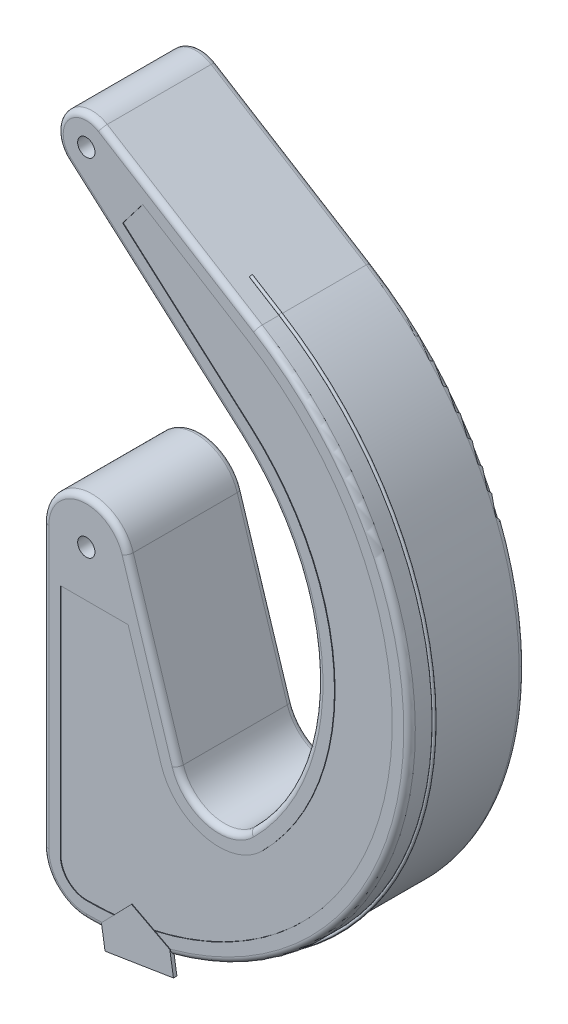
ISO-10303-21;
HEADER;
FILE_DESCRIPTION(('STEP AP214'),'2;1');
FILE_NAME('part.step','',(''),(''),'','','');
FILE_SCHEMA(('AUTOMOTIVE_DESIGN { 1 0 10303 214 1 1 1 1 }'));
ENDSEC;
DATA;
#1=APPLICATION_CONTEXT('core data for automotive mechanical design processes');
#2=APPLICATION_PROTOCOL_DEFINITION('international standard','automotive_design',2000,#1);
#3=PRODUCT_CONTEXT('',#1,'mechanical');
#4=PRODUCT('Part','Part','',(#3));
#5=PRODUCT_RELATED_PRODUCT_CATEGORY('part','',(#4));
#6=PRODUCT_DEFINITION_FORMATION('','',#4);
#7=PRODUCT_DEFINITION_CONTEXT('part definition',#1,'design');
#8=PRODUCT_DEFINITION('design','',#6,#7);
#9=PRODUCT_DEFINITION_SHAPE('','',#8);
#10=(LENGTH_UNIT() NAMED_UNIT(*) SI_UNIT(.MILLI.,.METRE.));
#11=(NAMED_UNIT(*) PLANE_ANGLE_UNIT() SI_UNIT($,.RADIAN.));
#12=(NAMED_UNIT(*) SI_UNIT($,.STERADIAN.) SOLID_ANGLE_UNIT());
#13=UNCERTAINTY_MEASURE_WITH_UNIT(LENGTH_MEASURE(1.E-05),#10,'distance_accuracy_value','');
#14=(GEOMETRIC_REPRESENTATION_CONTEXT(3) GLOBAL_UNCERTAINTY_ASSIGNED_CONTEXT((#13)) GLOBAL_UNIT_ASSIGNED_CONTEXT((#10,
#11,#12)) REPRESENTATION_CONTEXT('',''));
#15=CARTESIAN_POINT('',(0.,0.,0.));
#16=DIRECTION('',(0.,0.,1.));
#17=DIRECTION('',(1.,0.,0.));
#18=AXIS2_PLACEMENT_3D('',#15,#16,#17);
#19=CARTESIAN_POINT('',(29.6315261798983,47.8125,6.));
#20=DIRECTION('',(-0.85,0.526782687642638,0.));
#21=DIRECTION('',(-0.526782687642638,-0.85,0.));
#22=AXIS2_PLACEMENT_3D('',#19,#20,#21);
#23=CYLINDRICAL_SURFACE('',#22,0.25);
#24=CARTESIAN_POINT('',(29.6315261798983,47.8125,6.));
#25=DIRECTION('',(0.85,-0.526782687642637,0.));
#26=DIRECTION('',(0.526782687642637,0.85,0.));
#27=AXIS2_PLACEMENT_3D('',#24,#25,#26);
#28=CIRCLE('',#27,0.25);
#29=CARTESIAN_POINT('',(29.763221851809,48.025,6.));
#30=VERTEX_POINT('',#29);
#31=EDGE_CURVE('E55',#30,#30,#28,.T.);
#32=ORIENTED_EDGE('',*,*,#31,.F.);
#33=EDGE_LOOP('',(#32));
#34=FACE_BOUND('',#33,.T.);
#35=CARTESIAN_POINT('',(24.5315261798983,50.9731961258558,6.));
#36=DIRECTION('',(0.85,-0.526782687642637,0.));
#37=DIRECTION('',(0.526782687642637,0.85,0.));
#38=AXIS2_PLACEMENT_3D('',#35,#36,#37);
#39=CIRCLE('',#38,0.25);
#40=CARTESIAN_POINT('',(24.663221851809,51.1856961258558,6.));
#41=VERTEX_POINT('',#40);
#42=EDGE_CURVE('E11',#41,#41,#39,.T.);
#43=ORIENTED_EDGE('',*,*,#42,.T.);
#44=EDGE_LOOP('',(#43));
#45=FACE_BOUND('',#44,.T.);
#46=ADVANCED_FACE('F49',(#34,#45),#23,.T.);
#47=CARTESIAN_POINT('',(0.,0.,6.));
#48=DIRECTION('',(0.,0.,1.));
#49=DIRECTION('',(1.,0.,0.));
#50=AXIS2_PLACEMENT_3D('',#47,#48,#49);
#51=TOROIDAL_SURFACE('',#50,56.25,0.25);
#52=CARTESIAN_POINT('',(0.,-56.25,6.));
#53=DIRECTION('',(-1.,0.,0.));
#54=DIRECTION('',(0.,-1.,0.));
#55=AXIS2_PLACEMENT_3D('',#52,#53,#54);
#56=CIRCLE('',#55,0.25);
#57=CARTESIAN_POINT('',(0.,-56.5,6.));
#58=VERTEX_POINT('',#57);
#59=EDGE_CURVE('E59',#58,#58,#56,.T.);
#60=CARTESIAN_POINT('',(0.,0.,6.));
#61=DIRECTION('',(0.,0.,1.));
#62=DIRECTION('',(1.,0.,0.));
#63=AXIS2_PLACEMENT_3D('',#60,#61,#62);
#64=CIRCLE('',#63,56.5);
#65=EDGE_CURVE('',#58,#30,#64,.T.);
#66=ORIENTED_EDGE('',*,*,#59,.F.);
#67=ORIENTED_EDGE('',*,*,#31,.T.);
#68=ORIENTED_EDGE('',*,*,#65,.T.);
#69=ORIENTED_EDGE('',*,*,#65,.F.);
#70=EDGE_LOOP('',(#66,#68,#67,#69));
#71=FACE_BOUND('',#70,.T.);
#72=ADVANCED_FACE('F78',(#71),#51,.T.);
#73=CARTESIAN_POINT('',(0.,-48.5,6.));
#74=DIRECTION('',(0.,0.,1.));
#75=DIRECTION('',(1.,0.,0.));
#76=AXIS2_PLACEMENT_3D('',#73,#74,#75);
#77=TOROIDAL_SURFACE('',#76,7.75,0.25);
#78=CARTESIAN_POINT('',(-7.75,-48.5,6.));
#79=DIRECTION('',(0.,1.,0.));
#80=DIRECTION('',(-1.,0.,0.));
#81=AXIS2_PLACEMENT_3D('',#78,#79,#80);
#82=CIRCLE('',#81,0.25);
#83=CARTESIAN_POINT('',(-8.,-48.5,6.));
#84=VERTEX_POINT('',#83);
#85=EDGE_CURVE('E63',#84,#84,#82,.T.);
#86=CARTESIAN_POINT('',(0.,-48.5,6.));
#87=DIRECTION('',(0.,0.,1.));
#88=DIRECTION('',(1.,0.,0.));
#89=AXIS2_PLACEMENT_3D('',#86,#87,#88);
#90=CIRCLE('',#89,8.);
#91=EDGE_CURVE('',#84,#58,#90,.T.);
#92=ORIENTED_EDGE('',*,*,#85,.F.);
#93=ORIENTED_EDGE('',*,*,#59,.T.);
#94=ORIENTED_EDGE('',*,*,#91,.T.);
#95=ORIENTED_EDGE('',*,*,#91,.F.);
#96=EDGE_LOOP('',(#92,#94,#93,#95));
#97=FACE_BOUND('',#96,.T.);
#98=ADVANCED_FACE('F75',(#97),#77,.T.);
#99=CARTESIAN_POINT('',(-7.75,-48.5,6.));
#100=DIRECTION('',(0.,1.,0.));
#101=DIRECTION('',(0.,0.,1.));
#102=AXIS2_PLACEMENT_3D('',#99,#100,#101);
#103=CYLINDRICAL_SURFACE('',#102,0.25);
#104=ORIENTED_EDGE('',*,*,#85,.T.);
#105=EDGE_LOOP('',(#104));
#106=FACE_BOUND('',#105,.T.);
#107=CARTESIAN_POINT('',(-7.75,-43.5,6.));
#108=DIRECTION('',(0.,1.,0.));
#109=DIRECTION('',(-1.,0.,0.));
#110=AXIS2_PLACEMENT_3D('',#107,#108,#109);
#111=CIRCLE('',#110,0.25);
#112=CARTESIAN_POINT('',(-8.,-43.5,6.));
#113=VERTEX_POINT('',#112);
#114=EDGE_CURVE('E66',#113,#113,#111,.T.);
#115=ORIENTED_EDGE('',*,*,#114,.F.);
#116=EDGE_LOOP('',(#115));
#117=FACE_BOUND('',#116,.T.);
#118=ADVANCED_FACE('F72',(#106,#117),#103,.T.);
#119=CARTESIAN_POINT('',(24.5315261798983,50.9731961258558,6.));
#120=DIRECTION('',(0.85,-0.526782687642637,0.));
#121=DIRECTION('',(0.526782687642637,0.85,0.));
#122=AXIS2_PLACEMENT_3D('',#119,#120,#121);
#123=PLANE('',#122);
#124=ORIENTED_EDGE('',*,*,#42,.F.);
#125=EDGE_LOOP('',(#124));
#126=FACE_BOUND('',#125,.T.);
#127=ADVANCED_FACE('F90',(#126),#123,.F.);
#128=CARTESIAN_POINT('',(-7.75,-43.5,6.));
#129=DIRECTION('',(0.,1.,0.));
#130=DIRECTION('',(-1.,0.,0.));
#131=AXIS2_PLACEMENT_3D('',#128,#129,#130);
#132=PLANE('',#131);
#133=ORIENTED_EDGE('',*,*,#114,.T.);
#134=EDGE_LOOP('',(#133));
#135=FACE_BOUND('',#134,.T.);
#136=ADVANCED_FACE('F91',(#135),#132,.T.);
#137=CLOSED_SHELL('',(#46,#72,#98,#118,#127,#136));
#138=MANIFOLD_SOLID_BREP('B2',#137);
#139=CARTESIAN_POINT('',(2.5,-43.5,-6.));
#140=DIRECTION('',(0.,0.,-1.));
#141=DIRECTION('',(-1.,0.,0.));
#142=AXIS2_PLACEMENT_3D('',#139,#140,#141);
#143=PLANE('',#142);
#144=CARTESIAN_POINT('',(-3.5,-39.5,-6.));
#145=DIRECTION('',(0.,0.,-1.));
#146=DIRECTION('',(-1.,0.,0.));
#147=AXIS2_PLACEMENT_3D('',#144,#145,#146);
#148=CIRCLE('',#147,1.);
#149=CARTESIAN_POINT('',(-4.5,-39.5,-6.));
#150=VERTEX_POINT('',#149);
#151=EDGE_CURVE('E144',#150,#150,#148,.F.);
#152=ORIENTED_EDGE('',*,*,#151,.F.);
#153=EDGE_LOOP('',(#152));
#154=FACE_BOUND('',#153,.T.);
#155=DIRECTION('',(0.,-1.,0.));
#156=VECTOR('',#155,1.);
#157=CARTESIAN_POINT('',(-7.5,-43.5,-6.));
#158=LINE('',#157,#156);
#159=CARTESIAN_POINT('',(-7.5,-5.5,-6.));
#160=VERTEX_POINT('',#159);
#161=CARTESIAN_POINT('',(-7.5,-43.5,-6.));
#162=VERTEX_POINT('',#161);
#163=EDGE_CURVE('E151',#160,#162,#158,.T.);
#164=ORIENTED_EDGE('',*,*,#163,.T.);
#165=DIRECTION('',(-1.,0.,0.));
#166=VECTOR('',#165,1.);
#167=CARTESIAN_POINT('',(2.5,-43.5,-6.));
#168=LINE('',#167,#166);
#169=CARTESIAN_POINT('',(2.5,-43.5,-6.));
#170=VERTEX_POINT('',#169);
#171=EDGE_CURVE('E457',#170,#162,#168,.T.);
#172=ORIENTED_EDGE('',*,*,#171,.F.);
#173=DIRECTION('',(0.,-1.,0.));
#174=VECTOR('',#173,1.);
#175=CARTESIAN_POINT('',(2.5,-43.5,-6.));
#176=LINE('',#175,#174);
#177=CARTESIAN_POINT('',(2.5,-5.5,-6.));
#178=VERTEX_POINT('',#177);
#179=EDGE_CURVE('E461',#178,#170,#176,.T.);
#180=ORIENTED_EDGE('',*,*,#179,.F.);
#181=DIRECTION('',(-1.,0.,0.));
#182=VECTOR('',#181,1.);
#183=CARTESIAN_POINT('',(2.5,-5.5,-6.));
#184=LINE('',#183,#182);
#185=EDGE_CURVE('E495',#178,#160,#184,.T.);
#186=ORIENTED_EDGE('',*,*,#185,.T.);
#187=EDGE_LOOP('',(#164,#172,#180,#186));
#188=FACE_BOUND('',#187,.T.);
#189=CARTESIAN_POINT('',(-4.,-15.9853268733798,-6.));
#190=DIRECTION('',(0.,0.,-1.));
#191=DIRECTION('',(0.,1.,0.));
#192=AXIS2_PLACEMENT_3D('',#189,#190,#191);
#193=ELLIPSE('',#192,0.288675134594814,0.25);
#194=CARTESIAN_POINT('',(-4.,-15.696651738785,-6.));
#195=VERTEX_POINT('',#194);
#196=EDGE_CURVE('E47',#195,#195,#193,.F.);
#197=ORIENTED_EDGE('',*,*,#196,.F.);
#198=EDGE_LOOP('',(#197));
#199=FACE_BOUND('',#198,.T.);
#200=ADVANCED_FACE('F135',(#154,#188,#199),#143,.F.);
#201=CARTESIAN_POINT('',(2.5,-43.5,6.));
#202=DIRECTION('',(0.,0.,1.));
#203=DIRECTION('',(1.,0.,0.));
#204=AXIS2_PLACEMENT_3D('',#201,#202,#203);
#205=PLANE('',#204);
#206=CARTESIAN_POINT('',(-4.,-15.9853268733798,6.));
#207=DIRECTION('',(0.,0.,1.));
#208=DIRECTION('',(0.,1.,0.));
#209=AXIS2_PLACEMENT_3D('',#206,#207,#208);
#210=ELLIPSE('',#209,0.288675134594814,0.25);
#211=CARTESIAN_POINT('',(-4.,-15.696651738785,6.));
#212=VERTEX_POINT('',#211);
#213=EDGE_CURVE('E139',#212,#212,#210,.T.);
#214=ORIENTED_EDGE('',*,*,#213,.T.);
#215=EDGE_LOOP('',(#214));
#216=FACE_BOUND('',#215,.T.);
#217=DIRECTION('',(0.,1.,0.));
#218=VECTOR('',#217,1.);
#219=CARTESIAN_POINT('',(-7.5,-43.5,6.));
#220=LINE('',#219,#218);
#221=CARTESIAN_POINT('',(-7.5,-43.5,6.));
#222=VERTEX_POINT('',#221);
#223=CARTESIAN_POINT('',(-7.5,-5.5,6.));
#224=VERTEX_POINT('',#223);
#225=EDGE_CURVE('E482',#222,#224,#220,.T.);
#226=ORIENTED_EDGE('',*,*,#225,.T.);
#227=DIRECTION('',(-1.,0.,0.));
#228=VECTOR('',#227,1.);
#229=CARTESIAN_POINT('',(2.5,-5.5,6.));
#230=LINE('',#229,#228);
#231=CARTESIAN_POINT('',(2.5,-5.5,6.));
#232=VERTEX_POINT('',#231);
#233=EDGE_CURVE('E498',#232,#224,#230,.T.);
#234=ORIENTED_EDGE('',*,*,#233,.F.);
#235=DIRECTION('',(0.,1.,0.));
#236=VECTOR('',#235,1.);
#237=CARTESIAN_POINT('',(2.5,-43.5,6.));
#238=LINE('',#237,#236);
#239=CARTESIAN_POINT('',(2.5,-43.5,6.));
#240=VERTEX_POINT('',#239);
#241=EDGE_CURVE('E475',#240,#232,#238,.T.);
#242=ORIENTED_EDGE('',*,*,#241,.F.);
#243=DIRECTION('',(-1.,0.,0.));
#244=VECTOR('',#243,1.);
#245=CARTESIAN_POINT('',(2.5,-43.5,6.));
#246=LINE('',#245,#244);
#247=EDGE_CURVE('E466',#240,#222,#246,.T.);
#248=ORIENTED_EDGE('',*,*,#247,.T.);
#249=EDGE_LOOP('',(#226,#234,#242,#248));
#250=FACE_BOUND('',#249,.T.);
#251=CARTESIAN_POINT('',(-3.5,-39.5,6.));
#252=DIRECTION('',(0.,0.,1.));
#253=DIRECTION('',(1.,0.,0.));
#254=AXIS2_PLACEMENT_3D('',#251,#252,#253);
#255=CIRCLE('',#254,1.);
#256=CARTESIAN_POINT('',(-2.5,-39.5,6.));
#257=VERTEX_POINT('',#256);
#258=EDGE_CURVE('E1229',#257,#257,#255,.F.);
#259=ORIENTED_EDGE('',*,*,#258,.F.);
#260=EDGE_LOOP('',(#259));
#261=FACE_BOUND('',#260,.T.);
#262=ADVANCED_FACE('F938',(#216,#250,#261),#205,.F.);
#263=CARTESIAN_POINT('',(0.,0.,10.));
#264=DIRECTION('',(0.,0.,1.));
#265=DIRECTION('',(1.,0.,0.));
#266=AXIS2_PLACEMENT_3D('',#263,#264,#265);
#267=PLANE('',#266);
#268=CARTESIAN_POINT('',(0.,60.,10.));
#269=DIRECTION('',(0.,0.,1.));
#270=DIRECTION('',(1.,0.,0.));
#271=AXIS2_PLACEMENT_3D('',#268,#269,#270);
#272=CIRCLE('',#271,1.5);
#273=CARTESIAN_POINT('',(1.5,60.,10.));
#274=VERTEX_POINT('',#273);
#275=EDGE_CURVE('E702',#274,#274,#272,.T.);
#276=ORIENTED_EDGE('',*,*,#275,.F.);
#277=EDGE_LOOP('',(#276));
#278=FACE_BOUND('',#277,.T.);
#279=CARTESIAN_POINT('',(0.,0.,10.));
#280=DIRECTION('',(0.,0.,1.));
#281=DIRECTION('',(1.,0.,0.));
#282=AXIS2_PLACEMENT_3D('',#279,#280,#281);
#283=CIRCLE('',#282,1.5);
#284=CARTESIAN_POINT('',(1.5,0.,10.));
#285=VERTEX_POINT('',#284);
#286=EDGE_CURVE('E694',#285,#285,#283,.T.);
#287=ORIENTED_EDGE('',*,*,#286,.F.);
#288=EDGE_LOOP('',(#287));
#289=FACE_BOUND('',#288,.T.);
#290=DIRECTION('',(0.85,-0.526782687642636,0.));
#291=VECTOR('',#290,1.);
#292=CARTESIAN_POINT('',(9.76249327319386,56.3026912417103,10.));
#293=LINE('',#292,#291);
#294=CARTESIAN_POINT('',(9.76249327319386,56.3026912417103,10.));
#295=VERTEX_POINT('',#294);
#296=CARTESIAN_POINT('',(27.9194824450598,45.05,10.));
#297=VERTEX_POINT('',#296);
#298=EDGE_CURVE('E548',#295,#297,#293,.T.);
#299=ORIENTED_EDGE('',*,*,#298,.T.);
#300=CARTESIAN_POINT('',(0.,0.,10.));
#301=DIRECTION('',(0.,0.,-1.));
#302=DIRECTION('',(-1.,0.,0.));
#303=AXIS2_PLACEMENT_3D('',#300,#301,#302);
#304=CIRCLE('',#303,53.);
#305=CARTESIAN_POINT('',(11.9105514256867,-51.6443488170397,10.));
#306=VERTEX_POINT('',#305);
#307=EDGE_CURVE('E545',#297,#306,#304,.T.);
#308=ORIENTED_EDGE('',*,*,#307,.T.);
#309=DIRECTION('',(0.885734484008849,-0.464192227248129,0.));
#310=VECTOR('',#309,1.);
#311=CARTESIAN_POINT('',(-18.6672097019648,-35.6192766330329,10.));
#312=LINE('',#311,#310);
#313=CARTESIAN_POINT('',(14.5661620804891,-53.0360907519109,10.));
#314=VERTEX_POINT('',#313);
#315=EDGE_CURVE('E690',#306,#314,#312,.T.);
#316=ORIENTED_EDGE('',*,*,#315,.T.);
#317=CARTESIAN_POINT('',(0.,0.,10.));
#318=DIRECTION('',(0.,0.,1.));
#319=DIRECTION('',(1.,0.,0.));
#320=AXIS2_PLACEMENT_3D('',#317,#318,#319);
#321=CIRCLE('',#320,55.);
#322=CARTESIAN_POINT('',(28.973047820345,46.75,10.));
#323=VERTEX_POINT('',#322);
#324=EDGE_CURVE('E780',#314,#323,#321,.T.);
#325=ORIENTED_EDGE('',*,*,#324,.T.);
#326=DIRECTION('',(-0.850000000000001,0.526782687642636,0.));
#327=VECTOR('',#326,1.);
#328=CARTESIAN_POINT('',(2.10713075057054,63.4,10.));
#329=LINE('',#328,#327);
#330=CARTESIAN_POINT('',(2.10713075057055,63.4,10.));
#331=VERTEX_POINT('',#330);
#332=EDGE_CURVE('E778',#323,#331,#329,.T.);
#333=ORIENTED_EDGE('',*,*,#332,.T.);
#334=CARTESIAN_POINT('',(0.,60.,10.));
#335=DIRECTION('',(0.,0.,1.));
#336=DIRECTION('',(1.,0.,0.));
#337=AXIS2_PLACEMENT_3D('',#334,#335,#336);
#338=CIRCLE('',#337,4.);
#339=CARTESIAN_POINT('',(-2.64575131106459,57.,10.));
#340=VERTEX_POINT('',#339);
#341=EDGE_CURVE('E764',#331,#340,#338,.T.);
#342=ORIENTED_EDGE('',*,*,#341,.T.);
#343=DIRECTION('',(0.75,-0.661437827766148,0.));
#344=VECTOR('',#343,1.);
#345=CARTESIAN_POINT('',(27.118950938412,30.75,10.));
#346=LINE('',#345,#344);
#347=CARTESIAN_POINT('',(27.118950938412,30.75,10.));
#348=VERTEX_POINT('',#347);
#349=EDGE_CURVE('E766',#340,#348,#346,.T.);
#350=ORIENTED_EDGE('',*,*,#349,.T.);
#351=CARTESIAN_POINT('',(0.,0.,10.));
#352=DIRECTION('',(0.,0.,1.));
#353=DIRECTION('',(1.,0.,0.));
#354=AXIS2_PLACEMENT_3D('',#351,#352,#353);
#355=CIRCLE('',#354,41.);
#356=CARTESIAN_POINT('',(28.9913780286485,-28.9913780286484,10.));
#357=VERTEX_POINT('',#356);
#358=EDGE_CURVE('E768',#348,#357,#355,.F.);
#359=ORIENTED_EDGE('',*,*,#358,.T.);
#360=CARTESIAN_POINT('',(22.9809703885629,-22.9809703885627,10.));
#361=DIRECTION('',(0.,0.,1.));
#362=DIRECTION('',(1.,0.,0.));
#363=AXIS2_PLACEMENT_3D('',#360,#361,#362);
#364=CIRCLE('',#363,8.50000000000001);
#365=CARTESIAN_POINT('',(14.8749820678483,-25.538890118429,10.));
#366=VERTEX_POINT('',#365);
#367=EDGE_CURVE('E770',#357,#366,#364,.F.);
#368=ORIENTED_EDGE('',*,*,#367,.T.);
#369=DIRECTION('',(-0.300931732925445,0.953645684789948,0.));
#370=VECTOR('',#369,1.);
#371=CARTESIAN_POINT('',(6.19869695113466,1.95605626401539,10.));
#372=LINE('',#371,#370);
#373=CARTESIAN_POINT('',(6.19869695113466,1.95605626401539,10.));
#374=VERTEX_POINT('',#373);
#375=EDGE_CURVE('E772',#366,#374,#372,.T.);
#376=ORIENTED_EDGE('',*,*,#375,.T.);
#377=CARTESIAN_POINT('',(0.,0.,10.));
#378=DIRECTION('',(0.,0.,1.));
#379=DIRECTION('',(1.,0.,0.));
#380=AXIS2_PLACEMENT_3D('',#377,#378,#379);
#381=CIRCLE('',#380,6.5);
#382=CARTESIAN_POINT('',(-6.5,0.,10.));
#383=VERTEX_POINT('',#382);
#384=EDGE_CURVE('E774',#374,#383,#381,.T.);
#385=ORIENTED_EDGE('',*,*,#384,.T.);
#386=DIRECTION('',(0.,-1.,0.));
#387=VECTOR('',#386,1.);
#388=CARTESIAN_POINT('',(-6.5,-48.5,10.));
#389=LINE('',#388,#387);
#390=CARTESIAN_POINT('',(-6.5,-48.5,10.));
#391=VERTEX_POINT('',#390);
#392=EDGE_CURVE('E776',#383,#391,#389,.T.);
#393=ORIENTED_EDGE('',*,*,#392,.T.);
#394=CARTESIAN_POINT('',(0.,-48.5,10.));
#395=DIRECTION('',(0.,0.,1.));
#396=DIRECTION('',(1.,0.,0.));
#397=AXIS2_PLACEMENT_3D('',#394,#395,#396);
#398=CIRCLE('',#397,6.5);
#399=CARTESIAN_POINT('',(0.,-55.,10.));
#400=VERTEX_POINT('',#399);
#401=EDGE_CURVE('E784',#391,#400,#398,.T.);
#402=ORIENTED_EDGE('',*,*,#401,.T.);
#403=CARTESIAN_POINT('',(2.71701399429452,-54.9328484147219,10.));
#404=VERTEX_POINT('',#403);
#405=EDGE_CURVE('E781',#400,#404,#321,.T.);
#406=ORIENTED_EDGE('',*,*,#405,.T.);
#407=DIRECTION('',(0.696577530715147,0.717481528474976,0.));
#408=VECTOR('',#407,1.);
#409=CARTESIAN_POINT('',(28.8530857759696,-28.0124441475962,10.));
#410=LINE('',#409,#408);
#411=CARTESIAN_POINT('',(4.80549394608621,-52.7816940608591,10.));
#412=VERTEX_POINT('',#411);
#413=EDGE_CURVE('E687',#404,#412,#410,.T.);
#414=ORIENTED_EDGE('',*,*,#413,.T.);
#415=CARTESIAN_POINT('',(0.,-53.,10.));
#416=VERTEX_POINT('',#415);
#417=EDGE_CURVE('E544',#412,#416,#304,.T.);
#418=ORIENTED_EDGE('',*,*,#417,.T.);
#419=CARTESIAN_POINT('',(0.,-48.5,10.));
#420=DIRECTION('',(0.,0.,-1.));
#421=DIRECTION('',(-1.,0.,0.));
#422=AXIS2_PLACEMENT_3D('',#419,#420,#421);
#423=CIRCLE('',#422,4.5);
#424=CARTESIAN_POINT('',(-4.5,-48.5,10.));
#425=VERTEX_POINT('',#424);
#426=EDGE_CURVE('E541',#416,#425,#423,.T.);
#427=ORIENTED_EDGE('',*,*,#426,.T.);
#428=DIRECTION('',(0.,1.,0.));
#429=VECTOR('',#428,1.);
#430=CARTESIAN_POINT('',(-4.5,-48.5,10.));
#431=LINE('',#430,#429);
#432=CARTESIAN_POINT('',(-4.5,-8.,10.));
#433=VERTEX_POINT('',#432);
#434=EDGE_CURVE('E538',#425,#433,#431,.T.);
#435=ORIENTED_EDGE('',*,*,#434,.T.);
#436=DIRECTION('',(1.,0.,0.));
#437=VECTOR('',#436,1.);
#438=CARTESIAN_POINT('',(7.24320780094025,-8.,10.));
#439=LINE('',#438,#437);
#440=CARTESIAN_POINT('',(7.24320780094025,-8.,10.));
#441=VERTEX_POINT('',#440);
#442=EDGE_CURVE('E535',#433,#441,#439,.T.);
#443=ORIENTED_EDGE('',*,*,#442,.T.);
#444=DIRECTION('',(0.300931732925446,-0.953645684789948,0.));
#445=VECTOR('',#444,1.);
#446=CARTESIAN_POINT('',(7.24320780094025,-8.,10.));
#447=LINE('',#446,#445);
#448=CARTESIAN_POINT('',(12.9676906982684,-26.1407535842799,10.));
#449=VERTEX_POINT('',#448);
#450=EDGE_CURVE('E532',#441,#449,#447,.T.);
#451=ORIENTED_EDGE('',*,*,#450,.T.);
#452=CARTESIAN_POINT('',(22.9809703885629,-22.9809703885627,10.));
#453=DIRECTION('',(0.,0.,1.));
#454=DIRECTION('',(-1.,0.,0.));
#455=AXIS2_PLACEMENT_3D('',#452,#453,#454);
#456=CIRCLE('',#455,10.5);
#457=CARTESIAN_POINT('',(30.4055915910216,-30.4055915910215,10.));
#458=VERTEX_POINT('',#457);
#459=EDGE_CURVE('E529',#449,#458,#456,.T.);
#460=ORIENTED_EDGE('',*,*,#459,.T.);
#461=CARTESIAN_POINT('',(0.,0.,10.));
#462=DIRECTION('',(0.,0.,1.));
#463=DIRECTION('',(-1.,0.,0.));
#464=AXIS2_PLACEMENT_3D('',#461,#462,#463);
#465=CIRCLE('',#464,43.);
#466=CARTESIAN_POINT('',(28.4418265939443,32.25,10.));
#467=VERTEX_POINT('',#466);
#468=EDGE_CURVE('E526',#458,#467,#465,.T.);
#469=ORIENTED_EDGE('',*,*,#468,.T.);
#470=DIRECTION('',(-0.75,0.661437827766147,0.));
#471=VECTOR('',#470,1.);
#472=CARTESIAN_POINT('',(28.4418265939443,32.25,10.));
#473=LINE('',#472,#471);
#474=CARTESIAN_POINT('',(6.29990759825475,51.7773370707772,10.));
#475=VERTEX_POINT('',#474);
#476=EDGE_CURVE('E497',#467,#475,#473,.T.);
#477=ORIENTED_EDGE('',*,*,#476,.T.);
#478=DIRECTION('',(0.607673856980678,0.794186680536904,0.));
#479=VECTOR('',#478,1.);
#480=CARTESIAN_POINT('',(6.29990759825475,51.7773370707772,10.));
#481=LINE('',#480,#479);
#482=EDGE_CURVE('E505',#475,#295,#481,.T.);
#483=ORIENTED_EDGE('',*,*,#482,.T.);
#484=EDGE_LOOP('',(#299,#308,#316,#325,#333,#342,#350,#359,#368,#376,#385,#393,#402,#406,#414,
#418,#427,#435,#443,#451,#460,#469,#477,#483));
#485=FACE_BOUND('',#484,.T.);
#486=ADVANCED_FACE('F935',(#278,#289,#485),#267,.T.);
#487=CARTESIAN_POINT('',(0.,0.,9.));
#488=DIRECTION('',(0.,0.,1.));
#489=DIRECTION('',(1.,0.,0.));
#490=AXIS2_PLACEMENT_3D('',#487,#488,#489);
#491=TOROIDAL_SURFACE('',#490,55.,1.);
#492=CARTESIAN_POINT('',(0.,0.,9.5));
#493=DIRECTION('',(0.,0.,1.));
#494=DIRECTION('',(1.,0.,0.));
#495=AXIS2_PLACEMENT_3D('',#492,#493,#494);
#496=CIRCLE('',#495,55.8660254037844);
#497=CARTESIAN_POINT('',(14.7038577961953,-53.8962833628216,9.5));
#498=VERTEX_POINT('',#497);
#499=CARTESIAN_POINT('',(2.8547097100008,-55.7930410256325,9.5));
#500=VERTEX_POINT('',#499);
#501=EDGE_CURVE('E823',#498,#500,#496,.F.);
#502=ORIENTED_EDGE('',*,*,#501,.T.);
#503=CARTESIAN_POINT('',(2.85472806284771,-55.7931556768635,9.4998));
#504=CARTESIAN_POINT('',(2.85248784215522,-55.7791608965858,9.52421923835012));
#505=CARTESIAN_POINT('',(2.85008490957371,-55.7641496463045,9.54802520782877));
#506=CARTESIAN_POINT('',(2.84496988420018,-55.7321958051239,9.59426555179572));
#507=CARTESIAN_POINT('',(2.84225781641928,-55.7152533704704,9.61670003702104));
#508=CARTESIAN_POINT('',(2.83369862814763,-55.6617836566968,9.68160626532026));
#509=CARTESIAN_POINT('',(2.82741507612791,-55.6225299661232,9.72182689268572));
#510=CARTESIAN_POINT('',(2.81387020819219,-55.5379144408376,9.79504321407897));
#511=CARTESIAN_POINT('',(2.80660826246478,-55.4925486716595,9.8280342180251));
#512=CARTESIAN_POINT('',(2.79131391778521,-55.3970040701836,9.88588937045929));
#513=CARTESIAN_POINT('',(2.78328122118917,-55.3468233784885,9.91075036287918));
#514=CARTESIAN_POINT('',(2.76576620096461,-55.2374060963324,9.9538613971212));
#515=CARTESIAN_POINT('',(2.75622102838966,-55.1777768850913,9.97110674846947));
#516=CARTESIAN_POINT('',(2.74165059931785,-55.0867546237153,9.98841792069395));
#517=CARTESIAN_POINT('',(2.73674283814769,-55.0560955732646,9.99276223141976));
#518=CARTESIAN_POINT('',(2.72688503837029,-54.9945133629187,9.99855592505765));
#519=CARTESIAN_POINT('',(2.72193500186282,-54.9635902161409,10.000005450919));
#520=CARTESIAN_POINT('',(2.71698197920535,-54.9326484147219,9.99999997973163));
#521=B_SPLINE_CURVE_WITH_KNOTS('',3,(#503,#504,#505,#506,#507,#508,#509,#510,#511,#512,#513,
#514,#515,#516,#517,#518,#519,#520),.UNSPECIFIED.,.F.,.F.,(4,2,2,2,2,2,2,2,4),(0.,
0.0846502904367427,0.169293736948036,0.338079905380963,0.506975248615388,0.675936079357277,
0.863154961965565,0.957094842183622,1.05103008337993),.UNSPECIFIED.);
#522=EDGE_CURVE('E889',#500,#404,#521,.T.);
#523=ORIENTED_EDGE('',*,*,#522,.T.);
#524=ORIENTED_EDGE('',*,*,#405,.F.);
#525=CARTESIAN_POINT('',(0.,-55.,9.));
#526=DIRECTION('',(-1.,0.,0.));
#527=DIRECTION('',(0.,0.,1.));
#528=AXIS2_PLACEMENT_3D('',#525,#526,#527);
#529=CIRCLE('',#528,1.);
#530=CARTESIAN_POINT('',(0.,-56.,9.));
#531=VERTEX_POINT('',#530);
#532=EDGE_CURVE('E693',#531,#400,#529,.T.);
#533=ORIENTED_EDGE('',*,*,#532,.F.);
#534=CARTESIAN_POINT('',(0.,0.,9.));
#535=DIRECTION('',(0.,0.,1.));
#536=DIRECTION('',(1.,0.,0.));
#537=AXIS2_PLACEMENT_3D('',#534,#535,#536);
#538=CIRCLE('',#537,56.);
#539=CARTESIAN_POINT('',(29.4998305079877,47.6,9.));
#540=VERTEX_POINT('',#539);
#541=EDGE_CURVE('E791',#540,#531,#538,.F.);
#542=ORIENTED_EDGE('',*,*,#541,.F.);
#543=CARTESIAN_POINT('',(28.973047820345,46.75,9.));
#544=DIRECTION('',(0.850000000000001,-0.526782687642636,0.));
#545=DIRECTION('',(0.526782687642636,0.850000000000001,0.));
#546=AXIS2_PLACEMENT_3D('',#543,#544,#545);
#547=CIRCLE('',#546,1.);
#548=EDGE_CURVE('E855',#540,#323,#547,.T.);
#549=ORIENTED_EDGE('',*,*,#548,.T.);
#550=ORIENTED_EDGE('',*,*,#324,.F.);
#551=CARTESIAN_POINT('',(14.5661300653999,-53.0358907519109,9.99999997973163));
#552=CARTESIAN_POINT('',(14.5706249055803,-53.0639702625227,10.0000054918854));
#553=CARTESIAN_POINT('',(14.5751176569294,-53.0920367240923,9.99881209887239));
#554=CARTESIAN_POINT('',(14.5840712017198,-53.1479700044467,9.99403918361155));
#555=CARTESIAN_POINT('',(14.5885319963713,-53.1758368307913,9.99045975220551));
#556=CARTESIAN_POINT('',(14.6018040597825,-53.2587481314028,9.97618262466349));
#557=CARTESIAN_POINT('',(14.6105268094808,-53.3132396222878,9.96194598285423));
#558=CARTESIAN_POINT('',(14.6274742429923,-53.4191111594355,9.92439877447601));
#559=CARTESIAN_POINT('',(14.6356984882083,-53.4704884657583,9.90108034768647));
#560=CARTESIAN_POINT('',(14.6514094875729,-53.5686359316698,9.84602452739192));
#561=CARTESIAN_POINT('',(14.6588962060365,-53.615405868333,9.81428672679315));
#562=CARTESIAN_POINT('',(14.6735100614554,-53.7066994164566,9.74023335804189));
#563=CARTESIAN_POINT('',(14.6805539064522,-53.7507026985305,9.69725235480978));
#564=CARTESIAN_POINT('',(14.6900975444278,-53.8103223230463,9.62719624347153));
#565=CARTESIAN_POINT('',(14.6931132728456,-53.8291617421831,9.60286055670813));
#566=CARTESIAN_POINT('',(14.6987763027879,-53.8645389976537,9.55252890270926));
#567=CARTESIAN_POINT('',(14.7014235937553,-53.8810767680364,9.52653288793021));
#568=CARTESIAN_POINT('',(14.7038761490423,-53.8963980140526,9.49979999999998));
#569=B_SPLINE_CURVE_WITH_KNOTS('',3,(#551,#552,#553,#554,#555,#556,#557,#558,#559,#560,#561,
#562,#563,#564,#565,#566,#567,#568),.UNSPECIFIED.,.F.,.F.,(4,2,2,2,2,2,2,2,4),(0.,
0.0852589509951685,0.170514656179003,0.340617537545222,0.510867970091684,0.681126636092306,
0.865714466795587,0.958370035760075,1.05102825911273),.UNSPECIFIED.);
#570=EDGE_CURVE('E880',#314,#498,#569,.T.);
#571=ORIENTED_EDGE('',*,*,#570,.T.);
#572=EDGE_LOOP('',(#502,#523,#524,#533,#542,#549,#550,#571));
#573=FACE_BOUND('',#572,.T.);
#574=ADVANCED_FACE('F896',(#573),#491,.T.);
#575=CARTESIAN_POINT('',(0.,0.,-10.));
#576=DIRECTION('',(0.,0.,1.));
#577=DIRECTION('',(1.,0.,0.));
#578=AXIS2_PLACEMENT_3D('',#575,#576,#577);
#579=PLANE('',#578);
#580=DIRECTION('',(0.607673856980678,0.794186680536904,0.));
#581=VECTOR('',#580,1.);
#582=CARTESIAN_POINT('',(6.29990759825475,51.7773370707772,-10.));
#583=LINE('',#582,#581);
#584=CARTESIAN_POINT('',(6.29990759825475,51.7773370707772,-10.));
#585=VERTEX_POINT('',#584);
#586=CARTESIAN_POINT('',(9.76249327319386,56.3026912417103,-10.));
#587=VERTEX_POINT('',#586);
#588=EDGE_CURVE('E607',#585,#587,#583,.T.);
#589=ORIENTED_EDGE('',*,*,#588,.F.);
#590=DIRECTION('',(-0.75,0.661437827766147,0.));
#591=VECTOR('',#590,1.);
#592=CARTESIAN_POINT('',(28.4418265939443,32.25,-10.));
#593=LINE('',#592,#591);
#594=CARTESIAN_POINT('',(28.4418265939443,32.25,-10.));
#595=VERTEX_POINT('',#594);
#596=EDGE_CURVE('E556',#595,#585,#593,.T.);
#597=ORIENTED_EDGE('',*,*,#596,.F.);
#598=CARTESIAN_POINT('',(0.,0.,-10.));
#599=DIRECTION('',(0.,0.,1.));
#600=DIRECTION('',(-1.,0.,0.));
#601=AXIS2_PLACEMENT_3D('',#598,#599,#600);
#602=CIRCLE('',#601,43.);
#603=CARTESIAN_POINT('',(30.4055915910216,-30.4055915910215,-10.));
#604=VERTEX_POINT('',#603);
#605=EDGE_CURVE('E578',#604,#595,#602,.T.);
#606=ORIENTED_EDGE('',*,*,#605,.F.);
#607=CARTESIAN_POINT('',(22.9809703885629,-22.9809703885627,-10.));
#608=DIRECTION('',(0.,0.,1.));
#609=DIRECTION('',(-1.,0.,0.));
#610=AXIS2_PLACEMENT_3D('',#607,#608,#609);
#611=CIRCLE('',#610,10.5);
#612=CARTESIAN_POINT('',(12.9676906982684,-26.1407535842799,-10.));
#613=VERTEX_POINT('',#612);
#614=EDGE_CURVE('E628',#613,#604,#611,.T.);
#615=ORIENTED_EDGE('',*,*,#614,.F.);
#616=DIRECTION('',(0.300931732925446,-0.953645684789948,0.));
#617=VECTOR('',#616,1.);
#618=CARTESIAN_POINT('',(7.24320780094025,-8.,-10.));
#619=LINE('',#618,#617);
#620=CARTESIAN_POINT('',(7.24320780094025,-8.,-10.));
#621=VERTEX_POINT('',#620);
#622=EDGE_CURVE('E625',#621,#613,#619,.T.);
#623=ORIENTED_EDGE('',*,*,#622,.F.);
#624=DIRECTION('',(1.,0.,0.));
#625=VECTOR('',#624,1.);
#626=CARTESIAN_POINT('',(7.24320780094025,-8.,-10.));
#627=LINE('',#626,#625);
#628=CARTESIAN_POINT('',(-4.5,-8.,-10.));
#629=VERTEX_POINT('',#628);
#630=EDGE_CURVE('E622',#629,#621,#627,.T.);
#631=ORIENTED_EDGE('',*,*,#630,.F.);
#632=DIRECTION('',(0.,1.,0.));
#633=VECTOR('',#632,1.);
#634=CARTESIAN_POINT('',(-4.5,-48.5,-10.));
#635=LINE('',#634,#633);
#636=CARTESIAN_POINT('',(-4.5,-48.5,-10.));
#637=VERTEX_POINT('',#636);
#638=EDGE_CURVE('E619',#637,#629,#635,.T.);
#639=ORIENTED_EDGE('',*,*,#638,.F.);
#640=CARTESIAN_POINT('',(0.,-48.5,-10.));
#641=DIRECTION('',(0.,0.,-1.));
#642=DIRECTION('',(-1.,0.,0.));
#643=AXIS2_PLACEMENT_3D('',#640,#641,#642);
#644=CIRCLE('',#643,4.5);
#645=CARTESIAN_POINT('',(0.,-53.,-10.));
#646=VERTEX_POINT('',#645);
#647=EDGE_CURVE('E616',#646,#637,#644,.T.);
#648=ORIENTED_EDGE('',*,*,#647,.F.);
#649=CARTESIAN_POINT('',(0.,0.,-10.));
#650=DIRECTION('',(0.,0.,-1.));
#651=DIRECTION('',(-1.,0.,0.));
#652=AXIS2_PLACEMENT_3D('',#649,#650,#651);
#653=CIRCLE('',#652,53.);
#654=CARTESIAN_POINT('',(27.9194824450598,45.05,-10.));
#655=VERTEX_POINT('',#654);
#656=EDGE_CURVE('E613',#655,#646,#653,.T.);
#657=ORIENTED_EDGE('',*,*,#656,.F.);
#658=DIRECTION('',(0.85,-0.526782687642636,0.));
#659=VECTOR('',#658,1.);
#660=CARTESIAN_POINT('',(9.76249327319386,56.3026912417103,-10.));
#661=LINE('',#660,#659);
#662=EDGE_CURVE('E610',#587,#655,#661,.T.);
#663=ORIENTED_EDGE('',*,*,#662,.F.);
#664=EDGE_LOOP('',(#589,#597,#606,#615,#623,#631,#639,#648,#657,#663));
#665=FACE_BOUND('',#664,.T.);
#666=DIRECTION('',(-0.850000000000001,0.526782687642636,0.));
#667=VECTOR('',#666,1.);
#668=CARTESIAN_POINT('',(28.973047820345,46.75,-10.));
#669=LINE('',#668,#667);
#670=CARTESIAN_POINT('',(2.10713075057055,63.4,-10.));
#671=VERTEX_POINT('',#670);
#672=CARTESIAN_POINT('',(28.973047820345,46.75,-10.));
#673=VERTEX_POINT('',#672);
#674=EDGE_CURVE('E757',#671,#673,#669,.F.);
#675=ORIENTED_EDGE('',*,*,#674,.T.);
#676=CARTESIAN_POINT('',(0.,0.,-10.));
#677=DIRECTION('',(0.,0.,1.));
#678=DIRECTION('',(1.,0.,0.));
#679=AXIS2_PLACEMENT_3D('',#676,#677,#678);
#680=CIRCLE('',#679,55.);
#681=CARTESIAN_POINT('',(0.,-55.,-10.));
#682=VERTEX_POINT('',#681);
#683=EDGE_CURVE('E762',#673,#682,#680,.F.);
#684=ORIENTED_EDGE('',*,*,#683,.T.);
#685=CARTESIAN_POINT('',(0.,-48.5,-10.));
#686=DIRECTION('',(0.,0.,1.));
#687=DIRECTION('',(1.,0.,0.));
#688=AXIS2_PLACEMENT_3D('',#685,#686,#687);
#689=CIRCLE('',#688,6.5);
#690=CARTESIAN_POINT('',(-6.5,-48.5,-10.));
#691=VERTEX_POINT('',#690);
#692=EDGE_CURVE('E759',#682,#691,#689,.F.);
#693=ORIENTED_EDGE('',*,*,#692,.T.);
#694=DIRECTION('',(0.,-1.,0.));
#695=VECTOR('',#694,1.);
#696=CARTESIAN_POINT('',(-6.5,0.,-10.));
#697=LINE('',#696,#695);
#698=CARTESIAN_POINT('',(-6.5,0.,-10.));
#699=VERTEX_POINT('',#698);
#700=EDGE_CURVE('E755',#691,#699,#697,.F.);
#701=ORIENTED_EDGE('',*,*,#700,.T.);
#702=CARTESIAN_POINT('',(0.,0.,-10.));
#703=DIRECTION('',(0.,0.,1.));
#704=DIRECTION('',(1.,0.,0.));
#705=AXIS2_PLACEMENT_3D('',#702,#703,#704);
#706=CIRCLE('',#705,6.5);
#707=CARTESIAN_POINT('',(6.19869695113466,1.95605626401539,-10.));
#708=VERTEX_POINT('',#707);
#709=EDGE_CURVE('E753',#699,#708,#706,.F.);
#710=ORIENTED_EDGE('',*,*,#709,.T.);
#711=DIRECTION('',(-0.300931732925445,0.953645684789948,0.));
#712=VECTOR('',#711,1.);
#713=CARTESIAN_POINT('',(6.19869695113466,1.95605626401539,-10.));
#714=LINE('',#713,#712);
#715=CARTESIAN_POINT('',(14.8749820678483,-25.538890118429,-10.));
#716=VERTEX_POINT('',#715);
#717=EDGE_CURVE('E751',#708,#716,#714,.F.);
#718=ORIENTED_EDGE('',*,*,#717,.T.);
#719=CARTESIAN_POINT('',(22.9809703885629,-22.9809703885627,-10.));
#720=DIRECTION('',(0.,0.,1.));
#721=DIRECTION('',(1.,0.,0.));
#722=AXIS2_PLACEMENT_3D('',#719,#720,#721);
#723=CIRCLE('',#722,8.50000000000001);
#724=CARTESIAN_POINT('',(28.9913780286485,-28.9913780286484,-10.));
#725=VERTEX_POINT('',#724);
#726=EDGE_CURVE('E749',#716,#725,#723,.T.);
#727=ORIENTED_EDGE('',*,*,#726,.T.);
#728=CARTESIAN_POINT('',(0.,0.,-10.));
#729=DIRECTION('',(0.,0.,1.));
#730=DIRECTION('',(1.,0.,0.));
#731=AXIS2_PLACEMENT_3D('',#728,#729,#730);
#732=CIRCLE('',#731,41.);
#733=CARTESIAN_POINT('',(27.118950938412,30.75,-10.));
#734=VERTEX_POINT('',#733);
#735=EDGE_CURVE('E747',#725,#734,#732,.T.);
#736=ORIENTED_EDGE('',*,*,#735,.T.);
#737=DIRECTION('',(0.75,-0.661437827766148,0.));
#738=VECTOR('',#737,1.);
#739=CARTESIAN_POINT('',(27.118950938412,30.75,-10.));
#740=LINE('',#739,#738);
#741=CARTESIAN_POINT('',(-2.6457513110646,57.,-10.));
#742=VERTEX_POINT('',#741);
#743=EDGE_CURVE('E743',#734,#742,#740,.F.);
#744=ORIENTED_EDGE('',*,*,#743,.T.);
#745=CARTESIAN_POINT('',(0.,60.,-10.));
#746=DIRECTION('',(0.,0.,1.));
#747=DIRECTION('',(1.,0.,0.));
#748=AXIS2_PLACEMENT_3D('',#745,#746,#747);
#749=CIRCLE('',#748,4.);
#750=EDGE_CURVE('E745',#742,#671,#749,.F.);
#751=ORIENTED_EDGE('',*,*,#750,.T.);
#752=EDGE_LOOP('',(#675,#684,#693,#701,#710,#718,#727,#736,#744,#751));
#753=FACE_BOUND('',#752,.T.);
#754=CARTESIAN_POINT('',(0.,60.,-10.));
#755=DIRECTION('',(0.,0.,1.));
#756=DIRECTION('',(1.,0.,0.));
#757=AXIS2_PLACEMENT_3D('',#754,#755,#756);
#758=CIRCLE('',#757,1.5);
#759=CARTESIAN_POINT('',(1.5,60.,-10.));
#760=VERTEX_POINT('',#759);
#761=EDGE_CURVE('E697',#760,#760,#758,.T.);
#762=ORIENTED_EDGE('',*,*,#761,.T.);
#763=EDGE_LOOP('',(#762));
#764=FACE_BOUND('',#763,.T.);
#765=CARTESIAN_POINT('',(0.,0.,-10.));
#766=DIRECTION('',(0.,0.,1.));
#767=DIRECTION('',(1.,0.,0.));
#768=AXIS2_PLACEMENT_3D('',#765,#766,#767);
#769=CIRCLE('',#768,1.5);
#770=CARTESIAN_POINT('',(1.5,0.,-10.));
#771=VERTEX_POINT('',#770);
#772=EDGE_CURVE('E698',#771,#771,#769,.T.);
#773=ORIENTED_EDGE('',*,*,#772,.T.);
#774=EDGE_LOOP('',(#773));
#775=FACE_BOUND('',#774,.T.);
#776=ADVANCED_FACE('F940',(#665,#753,#764,#775),#579,.F.);
#777=CARTESIAN_POINT('',(0.,0.,10.));
#778=DIRECTION('',(0.,0.,-1.));
#779=DIRECTION('',(-1.,0.,0.));
#780=AXIS2_PLACEMENT_3D('',#777,#778,#779);
#781=CYLINDRICAL_SURFACE('',#780,56.);
#782=DIRECTION('',(0.,0.,-1.));
#783=VECTOR('',#782,1.);
#784=CARTESIAN_POINT('',(0.,-56.,10.));
#785=LINE('',#784,#783);
#786=CARTESIAN_POINT('',(0.,-56.,-9.));
#787=VERTEX_POINT('',#786);
#788=EDGE_CURVE('E705',#531,#787,#785,.T.);
#789=ORIENTED_EDGE('',*,*,#788,.T.);
#790=CARTESIAN_POINT('',(0.,0.,-9.));
#791=DIRECTION('',(0.,0.,1.));
#792=DIRECTION('',(1.,0.,0.));
#793=AXIS2_PLACEMENT_3D('',#790,#791,#792);
#794=CIRCLE('',#793,56.);
#795=CARTESIAN_POINT('',(29.4998305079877,47.6,-9.));
#796=VERTEX_POINT('',#795);
#797=EDGE_CURVE('E793',#787,#796,#794,.T.);
#798=ORIENTED_EDGE('',*,*,#797,.T.);
#799=DIRECTION('',(0.,0.,-1.));
#800=VECTOR('',#799,1.);
#801=CARTESIAN_POINT('',(29.4998305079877,47.6,10.));
#802=LINE('',#801,#800);
#803=EDGE_CURVE('E734',#540,#796,#802,.T.);
#804=ORIENTED_EDGE('',*,*,#803,.F.);
#805=ORIENTED_EDGE('',*,*,#541,.T.);
#806=EDGE_LOOP('',(#789,#798,#804,#805));
#807=FACE_BOUND('',#806,.T.);
#808=ADVANCED_FACE('F943',(#807),#781,.T.);
#809=CARTESIAN_POINT('',(2.63391343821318,64.25,10.));
#810=DIRECTION('',(-0.526782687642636,-0.850000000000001,0.));
#811=DIRECTION('',(0.850000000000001,-0.526782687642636,0.));
#812=AXIS2_PLACEMENT_3D('',#809,#810,#811);
#813=PLANE('',#812);
#814=ORIENTED_EDGE('',*,*,#803,.T.);
#815=DIRECTION('',(-0.850000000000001,0.526782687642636,0.));
#816=VECTOR('',#815,1.);
#817=CARTESIAN_POINT('',(2.63391343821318,64.25,-9.));
#818=LINE('',#817,#816);
#819=CARTESIAN_POINT('',(2.63391343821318,64.25,-9.));
#820=VERTEX_POINT('',#819);
#821=EDGE_CURVE('E789',#796,#820,#818,.T.);
#822=ORIENTED_EDGE('',*,*,#821,.T.);
#823=DIRECTION('',(0.,0.,-1.));
#824=VECTOR('',#823,1.);
#825=CARTESIAN_POINT('',(2.63391343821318,64.25,10.));
#826=LINE('',#825,#824);
#827=CARTESIAN_POINT('',(2.63391343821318,64.25,9.));
#828=VERTEX_POINT('',#827);
#829=EDGE_CURVE('E731',#828,#820,#826,.T.);
#830=ORIENTED_EDGE('',*,*,#829,.F.);
#831=DIRECTION('',(-0.850000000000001,0.526782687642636,0.));
#832=VECTOR('',#831,1.);
#833=CARTESIAN_POINT('',(29.4998305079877,47.6,9.));
#834=LINE('',#833,#832);
#835=EDGE_CURVE('E787',#828,#540,#834,.F.);
#836=ORIENTED_EDGE('',*,*,#835,.T.);
#837=EDGE_LOOP('',(#814,#822,#830,#836));
#838=FACE_BOUND('',#837,.T.);
#839=ADVANCED_FACE('F975',(#838),#813,.F.);
#840=CARTESIAN_POINT('',(0.,60.,10.));
#841=DIRECTION('',(0.,0.,-1.));
#842=DIRECTION('',(-1.,0.,0.));
#843=AXIS2_PLACEMENT_3D('',#840,#841,#842);
#844=CYLINDRICAL_SURFACE('',#843,5.);
#845=ORIENTED_EDGE('',*,*,#829,.T.);
#846=CARTESIAN_POINT('',(0.,60.,-9.));
#847=DIRECTION('',(0.,0.,1.));
#848=DIRECTION('',(1.,0.,0.));
#849=AXIS2_PLACEMENT_3D('',#846,#847,#848);
#850=CIRCLE('',#849,5.);
#851=CARTESIAN_POINT('',(-3.30718913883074,56.25,-9.));
#852=VERTEX_POINT('',#851);
#853=EDGE_CURVE('E817',#820,#852,#850,.T.);
#854=ORIENTED_EDGE('',*,*,#853,.T.);
#855=DIRECTION('',(0.,0.,-1.));
#856=VECTOR('',#855,1.);
#857=CARTESIAN_POINT('',(-3.30718913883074,56.25,10.));
#858=LINE('',#857,#856);
#859=CARTESIAN_POINT('',(-3.30718913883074,56.25,9.));
#860=VERTEX_POINT('',#859);
#861=EDGE_CURVE('E728',#860,#852,#858,.T.);
#862=ORIENTED_EDGE('',*,*,#861,.F.);
#863=CARTESIAN_POINT('',(0.,60.,9.));
#864=DIRECTION('',(0.,0.,1.));
#865=DIRECTION('',(1.,0.,0.));
#866=AXIS2_PLACEMENT_3D('',#863,#864,#865);
#867=CIRCLE('',#866,5.);
#868=EDGE_CURVE('E815',#860,#828,#867,.F.);
#869=ORIENTED_EDGE('',*,*,#868,.T.);
#870=EDGE_LOOP('',(#845,#854,#862,#869));
#871=FACE_BOUND('',#870,.T.);
#872=ADVANCED_FACE('F971',(#871),#844,.T.);
#873=CARTESIAN_POINT('',(-3.30718913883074,56.25,10.));
#874=DIRECTION('',(0.661437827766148,0.75,0.));
#875=DIRECTION('',(-0.75,0.661437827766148,0.));
#876=AXIS2_PLACEMENT_3D('',#873,#874,#875);
#877=PLANE('',#876);
#878=ORIENTED_EDGE('',*,*,#861,.T.);
#879=DIRECTION('',(0.75,-0.661437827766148,0.));
#880=VECTOR('',#879,1.);
#881=CARTESIAN_POINT('',(-3.30718913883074,56.25,-9.));
#882=LINE('',#881,#880);
#883=CARTESIAN_POINT('',(26.4575131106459,30.,-9.));
#884=VERTEX_POINT('',#883);
#885=EDGE_CURVE('E821',#852,#884,#882,.T.);
#886=ORIENTED_EDGE('',*,*,#885,.T.);
#887=DIRECTION('',(0.,0.,-1.));
#888=VECTOR('',#887,1.);
#889=CARTESIAN_POINT('',(26.4575131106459,30.,10.));
#890=LINE('',#889,#888);
#891=CARTESIAN_POINT('',(26.4575131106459,30.,9.));
#892=VERTEX_POINT('',#891);
#893=EDGE_CURVE('E725',#892,#884,#890,.T.);
#894=ORIENTED_EDGE('',*,*,#893,.F.);
#895=DIRECTION('',(0.75,-0.661437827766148,0.));
#896=VECTOR('',#895,1.);
#897=CARTESIAN_POINT('',(-3.30718913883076,56.25,9.));
#898=LINE('',#897,#896);
#899=EDGE_CURVE('E819',#892,#860,#898,.F.);
#900=ORIENTED_EDGE('',*,*,#899,.T.);
#901=EDGE_LOOP('',(#878,#886,#894,#900));
#902=FACE_BOUND('',#901,.T.);
#903=ADVANCED_FACE('F967',(#902),#877,.F.);
#904=CARTESIAN_POINT('',(0.,0.,10.));
#905=DIRECTION('',(0.,0.,-1.));
#906=DIRECTION('',(-1.,0.,0.));
#907=AXIS2_PLACEMENT_3D('',#904,#905,#906);
#908=CYLINDRICAL_SURFACE('',#907,40.);
#909=ORIENTED_EDGE('',*,*,#893,.T.);
#910=CARTESIAN_POINT('',(0.,0.,-9.));
#911=DIRECTION('',(0.,0.,1.));
#912=DIRECTION('',(1.,0.,0.));
#913=AXIS2_PLACEMENT_3D('',#910,#911,#912);
#914=CIRCLE('',#913,40.);
#915=CARTESIAN_POINT('',(28.284271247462,-28.2842712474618,-9.));
#916=VERTEX_POINT('',#915);
#917=EDGE_CURVE('E813',#884,#916,#914,.F.);
#918=ORIENTED_EDGE('',*,*,#917,.T.);
#919=DIRECTION('',(0.,0.,-1.));
#920=VECTOR('',#919,1.);
#921=CARTESIAN_POINT('',(28.284271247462,-28.2842712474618,10.));
#922=LINE('',#921,#920);
#923=CARTESIAN_POINT('',(28.284271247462,-28.2842712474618,9.));
#924=VERTEX_POINT('',#923);
#925=EDGE_CURVE('E722',#924,#916,#922,.T.);
#926=ORIENTED_EDGE('',*,*,#925,.F.);
#927=CARTESIAN_POINT('',(0.,0.,9.));
#928=DIRECTION('',(0.,0.,1.));
#929=DIRECTION('',(1.,0.,0.));
#930=AXIS2_PLACEMENT_3D('',#927,#928,#929);
#931=CIRCLE('',#930,40.);
#932=EDGE_CURVE('E811',#924,#892,#931,.T.);
#933=ORIENTED_EDGE('',*,*,#932,.T.);
#934=EDGE_LOOP('',(#909,#918,#926,#933));
#935=FACE_BOUND('',#934,.T.);
#936=ADVANCED_FACE('F963',(#935),#908,.F.);
#937=CARTESIAN_POINT('',(22.9809703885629,-22.9809703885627,10.));
#938=DIRECTION('',(0.,0.,-1.));
#939=DIRECTION('',(-1.,0.,0.));
#940=AXIS2_PLACEMENT_3D('',#937,#938,#939);
#941=CYLINDRICAL_SURFACE('',#940,7.50000000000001);
#942=ORIENTED_EDGE('',*,*,#925,.T.);
#943=CARTESIAN_POINT('',(22.9809703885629,-22.9809703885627,-9.));
#944=DIRECTION('',(0.,0.,1.));
#945=DIRECTION('',(1.,0.,0.));
#946=AXIS2_PLACEMENT_3D('',#943,#944,#945);
#947=CIRCLE('',#946,7.50000000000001);
#948=CARTESIAN_POINT('',(15.8286277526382,-25.2379583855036,-9.));
#949=VERTEX_POINT('',#948);
#950=EDGE_CURVE('E809',#916,#949,#947,.F.);
#951=ORIENTED_EDGE('',*,*,#950,.T.);
#952=DIRECTION('',(0.,0.,-1.));
#953=VECTOR('',#952,1.);
#954=CARTESIAN_POINT('',(15.8286277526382,-25.2379583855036,10.));
#955=LINE('',#954,#953);
#956=CARTESIAN_POINT('',(15.8286277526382,-25.2379583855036,9.));
#957=VERTEX_POINT('',#956);
#958=EDGE_CURVE('E719',#957,#949,#955,.T.);
#959=ORIENTED_EDGE('',*,*,#958,.F.);
#960=CARTESIAN_POINT('',(22.9809703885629,-22.9809703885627,9.));
#961=DIRECTION('',(0.,0.,1.));
#962=DIRECTION('',(1.,0.,0.));
#963=AXIS2_PLACEMENT_3D('',#960,#961,#962);
#964=CIRCLE('',#963,7.50000000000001);
#965=EDGE_CURVE('E807',#957,#924,#964,.T.);
#966=ORIENTED_EDGE('',*,*,#965,.T.);
#967=EDGE_LOOP('',(#942,#951,#959,#966));
#968=FACE_BOUND('',#967,.T.);
#969=ADVANCED_FACE('F959',(#968),#941,.F.);
#970=CARTESIAN_POINT('',(7.15234263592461,2.25698799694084,10.));
#971=DIRECTION('',(-0.953645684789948,-0.300931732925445,0.));
#972=DIRECTION('',(0.300931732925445,-0.953645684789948,0.));
#973=AXIS2_PLACEMENT_3D('',#970,#971,#972);
#974=PLANE('',#973);
#975=ORIENTED_EDGE('',*,*,#958,.T.);
#976=DIRECTION('',(-0.300931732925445,0.953645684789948,0.));
#977=VECTOR('',#976,1.);
#978=CARTESIAN_POINT('',(7.15234263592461,2.25698799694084,-9.));
#979=LINE('',#978,#977);
#980=CARTESIAN_POINT('',(7.15234263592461,2.25698799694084,-9.));
#981=VERTEX_POINT('',#980);
#982=EDGE_CURVE('E805',#949,#981,#979,.T.);
#983=ORIENTED_EDGE('',*,*,#982,.T.);
#984=DIRECTION('',(0.,0.,-1.));
#985=VECTOR('',#984,1.);
#986=CARTESIAN_POINT('',(7.15234263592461,2.25698799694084,10.));
#987=LINE('',#986,#985);
#988=CARTESIAN_POINT('',(7.15234263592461,2.25698799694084,9.));
#989=VERTEX_POINT('',#988);
#990=EDGE_CURVE('E716',#989,#981,#987,.T.);
#991=ORIENTED_EDGE('',*,*,#990,.F.);
#992=DIRECTION('',(-0.300931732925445,0.953645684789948,0.));
#993=VECTOR('',#992,1.);
#994=CARTESIAN_POINT('',(15.8286277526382,-25.2379583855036,9.));
#995=LINE('',#994,#993);
#996=EDGE_CURVE('E803',#989,#957,#995,.F.);
#997=ORIENTED_EDGE('',*,*,#996,.T.);
#998=EDGE_LOOP('',(#975,#983,#991,#997));
#999=FACE_BOUND('',#998,.T.);
#1000=ADVANCED_FACE('F955',(#999),#974,.F.);
#1001=CARTESIAN_POINT('',(0.,0.,10.));
#1002=DIRECTION('',(0.,0.,-1.));
#1003=DIRECTION('',(-1.,0.,0.));
#1004=AXIS2_PLACEMENT_3D('',#1001,#1002,#1003);
#1005=CYLINDRICAL_SURFACE('',#1004,7.5);
#1006=ORIENTED_EDGE('',*,*,#990,.T.);
#1007=CARTESIAN_POINT('',(0.,0.,-9.));
#1008=DIRECTION('',(0.,0.,1.));
#1009=DIRECTION('',(1.,0.,0.));
#1010=AXIS2_PLACEMENT_3D('',#1007,#1008,#1009);
#1011=CIRCLE('',#1010,7.5);
#1012=CARTESIAN_POINT('',(-7.5,0.,-9.));
#1013=VERTEX_POINT('',#1012);
#1014=EDGE_CURVE('E801',#981,#1013,#1011,.T.);
#1015=ORIENTED_EDGE('',*,*,#1014,.T.);
#1016=DIRECTION('',(0.,0.,-1.));
#1017=VECTOR('',#1016,1.);
#1018=CARTESIAN_POINT('',(-7.5,0.,10.));
#1019=LINE('',#1018,#1017);
#1020=CARTESIAN_POINT('',(-7.5,0.,9.));
#1021=VERTEX_POINT('',#1020);
#1022=EDGE_CURVE('E713',#1021,#1013,#1019,.T.);
#1023=ORIENTED_EDGE('',*,*,#1022,.F.);
#1024=CARTESIAN_POINT('',(0.,0.,9.));
#1025=DIRECTION('',(0.,0.,1.));
#1026=DIRECTION('',(1.,0.,0.));
#1027=AXIS2_PLACEMENT_3D('',#1024,#1025,#1026);
#1028=CIRCLE('',#1027,7.5);
#1029=EDGE_CURVE('E799',#1021,#989,#1028,.F.);
#1030=ORIENTED_EDGE('',*,*,#1029,.T.);
#1031=EDGE_LOOP('',(#1006,#1015,#1023,#1030));
#1032=FACE_BOUND('',#1031,.T.);
#1033=ADVANCED_FACE('F951',(#1032),#1005,.T.);
#1034=CARTESIAN_POINT('',(-7.5,0.,10.));
#1035=DIRECTION('',(1.,0.,0.));
#1036=DIRECTION('',(0.,1.,0.));
#1037=AXIS2_PLACEMENT_3D('',#1034,#1035,#1036);
#1038=PLANE('',#1037);
#1039=DIRECTION('',(0.,0.,1.));
#1040=VECTOR('',#1039,1.);
#1041=CARTESIAN_POINT('',(-7.5,-43.5,-6.));
#1042=LINE('',#1041,#1040);
#1043=EDGE_CURVE('E491',#162,#222,#1042,.T.);
#1044=ORIENTED_EDGE('',*,*,#1043,.F.);
#1045=ORIENTED_EDGE('',*,*,#163,.F.);
#1046=DIRECTION('',(0.,0.,-1.));
#1047=VECTOR('',#1046,1.);
#1048=CARTESIAN_POINT('',(-7.5,-5.5,-6.));
#1049=LINE('',#1048,#1047);
#1050=EDGE_CURVE('E479',#224,#160,#1049,.T.);
#1051=ORIENTED_EDGE('',*,*,#1050,.F.);
#1052=ORIENTED_EDGE('',*,*,#225,.F.);
#1053=EDGE_LOOP('',(#1044,#1045,#1051,#1052));
#1054=FACE_BOUND('',#1053,.T.);
#1055=ORIENTED_EDGE('',*,*,#1022,.T.);
#1056=DIRECTION('',(0.,-1.,0.));
#1057=VECTOR('',#1056,1.);
#1058=CARTESIAN_POINT('',(-7.5,0.,-9.));
#1059=LINE('',#1058,#1057);
#1060=CARTESIAN_POINT('',(-7.5,-48.5,-9.));
#1061=VERTEX_POINT('',#1060);
#1062=EDGE_CURVE('E797',#1013,#1061,#1059,.T.);
#1063=ORIENTED_EDGE('',*,*,#1062,.T.);
#1064=DIRECTION('',(0.,0.,-1.));
#1065=VECTOR('',#1064,1.);
#1066=CARTESIAN_POINT('',(-7.5,-48.5,10.));
#1067=LINE('',#1066,#1065);
#1068=CARTESIAN_POINT('',(-7.5,-48.5,9.));
#1069=VERTEX_POINT('',#1068);
#1070=EDGE_CURVE('E710',#1069,#1061,#1067,.T.);
#1071=ORIENTED_EDGE('',*,*,#1070,.F.);
#1072=DIRECTION('',(0.,-1.,0.));
#1073=VECTOR('',#1072,1.);
#1074=CARTESIAN_POINT('',(-7.5,0.,9.));
#1075=LINE('',#1074,#1073);
#1076=EDGE_CURVE('E795',#1069,#1021,#1075,.F.);
#1077=ORIENTED_EDGE('',*,*,#1076,.T.);
#1078=EDGE_LOOP('',(#1055,#1063,#1071,#1077));
#1079=FACE_BOUND('',#1078,.T.);
#1080=ADVANCED_FACE('F947',(#1054,#1079),#1038,.F.);
#1081=CARTESIAN_POINT('',(0.,-48.5,10.));
#1082=DIRECTION('',(0.,0.,-1.));
#1083=DIRECTION('',(-1.,0.,0.));
#1084=AXIS2_PLACEMENT_3D('',#1081,#1082,#1083);
#1085=CYLINDRICAL_SURFACE('',#1084,7.5);
#1086=ORIENTED_EDGE('',*,*,#1070,.T.);
#1087=CARTESIAN_POINT('',(0.,-48.5,-9.));
#1088=DIRECTION('',(0.,0.,1.));
#1089=DIRECTION('',(1.,0.,0.));
#1090=AXIS2_PLACEMENT_3D('',#1087,#1088,#1089);
#1091=CIRCLE('',#1090,7.5);
#1092=EDGE_CURVE('E740',#1061,#787,#1091,.T.);
#1093=ORIENTED_EDGE('',*,*,#1092,.T.);
#1094=ORIENTED_EDGE('',*,*,#788,.F.);
#1095=CARTESIAN_POINT('',(0.,-48.5,9.));
#1096=DIRECTION('',(0.,0.,1.));
#1097=DIRECTION('',(1.,0.,0.));
#1098=AXIS2_PLACEMENT_3D('',#1095,#1096,#1097);
#1099=CIRCLE('',#1098,7.5);
#1100=EDGE_CURVE('E737',#531,#1069,#1099,.F.);
#1101=ORIENTED_EDGE('',*,*,#1100,.T.);
#1102=EDGE_LOOP('',(#1086,#1093,#1094,#1101));
#1103=FACE_BOUND('',#1102,.T.);
#1104=ADVANCED_FACE('F933',(#1103),#1085,.T.);
#1105=CARTESIAN_POINT('',(0.,60.,10.));
#1106=DIRECTION('',(0.,0.,-1.));
#1107=DIRECTION('',(-1.,0.,0.));
#1108=AXIS2_PLACEMENT_3D('',#1105,#1106,#1107);
#1109=CYLINDRICAL_SURFACE('',#1108,1.5);
#1110=ORIENTED_EDGE('',*,*,#275,.T.);
#1111=EDGE_LOOP('',(#1110));
#1112=FACE_BOUND('',#1111,.T.);
#1113=ORIENTED_EDGE('',*,*,#761,.F.);
#1114=EDGE_LOOP('',(#1113));
#1115=FACE_BOUND('',#1114,.T.);
#1116=ADVANCED_FACE('F929',(#1112,#1115),#1109,.F.);
#1117=CARTESIAN_POINT('',(0.,0.,10.));
#1118=DIRECTION('',(0.,0.,-1.));
#1119=DIRECTION('',(-1.,0.,0.));
#1120=AXIS2_PLACEMENT_3D('',#1117,#1118,#1119);
#1121=CYLINDRICAL_SURFACE('',#1120,1.5);
#1122=ORIENTED_EDGE('',*,*,#286,.T.);
#1123=EDGE_LOOP('',(#1122));
#1124=FACE_BOUND('',#1123,.T.);
#1125=ORIENTED_EDGE('',*,*,#772,.F.);
#1126=EDGE_LOOP('',(#1125));
#1127=FACE_BOUND('',#1126,.T.);
#1128=ADVANCED_FACE('F925',(#1124,#1127),#1121,.F.);
#1129=CARTESIAN_POINT('',(0.,0.,-9.));
#1130=DIRECTION('',(0.,0.,1.));
#1131=DIRECTION('',(1.,0.,0.));
#1132=AXIS2_PLACEMENT_3D('',#1129,#1130,#1131);
#1133=TOROIDAL_SURFACE('',#1132,41.,1.);
#1134=CARTESIAN_POINT('',(27.118950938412,30.75,-9.));
#1135=DIRECTION('',(-0.75,0.661437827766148,0.));
#1136=DIRECTION('',(-0.661437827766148,-0.75,0.));
#1137=AXIS2_PLACEMENT_3D('',#1134,#1135,#1136);
#1138=CIRCLE('',#1137,1.);
#1139=EDGE_CURVE('E847',#734,#884,#1138,.T.);
#1140=ORIENTED_EDGE('',*,*,#1139,.F.);
#1141=ORIENTED_EDGE('',*,*,#735,.F.);
#1142=CARTESIAN_POINT('',(28.9913780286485,-28.9913780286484,-9.));
#1143=DIRECTION('',(-0.707106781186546,-0.707106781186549,0.));
#1144=DIRECTION('',(0.707106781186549,-0.707106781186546,0.));
#1145=AXIS2_PLACEMENT_3D('',#1142,#1143,#1144);
#1146=CIRCLE('',#1145,1.);
#1147=EDGE_CURVE('E701',#916,#725,#1146,.T.);
#1148=ORIENTED_EDGE('',*,*,#1147,.F.);
#1149=ORIENTED_EDGE('',*,*,#917,.F.);
#1150=EDGE_LOOP('',(#1140,#1141,#1148,#1149));
#1151=FACE_BOUND('',#1150,.T.);
#1152=ADVANCED_FACE('F928',(#1151),#1133,.T.);
#1153=CARTESIAN_POINT('',(22.9809703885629,-22.9809703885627,-9.));
#1154=DIRECTION('',(0.,0.,1.));
#1155=DIRECTION('',(1.,0.,0.));
#1156=AXIS2_PLACEMENT_3D('',#1153,#1154,#1155);
#1157=TOROIDAL_SURFACE('',#1156,8.50000000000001,1.);
#1158=ORIENTED_EDGE('',*,*,#1147,.T.);
#1159=ORIENTED_EDGE('',*,*,#726,.F.);
#1160=CARTESIAN_POINT('',(14.8749820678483,-25.538890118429,-9.));
#1161=DIRECTION('',(-0.300931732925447,0.953645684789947,0.));
#1162=DIRECTION('',(-0.953645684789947,-0.300931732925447,0.));
#1163=AXIS2_PLACEMENT_3D('',#1160,#1161,#1162);
#1164=CIRCLE('',#1163,1.);
#1165=EDGE_CURVE('E844',#949,#716,#1164,.T.);
#1166=ORIENTED_EDGE('',*,*,#1165,.F.);
#1167=ORIENTED_EDGE('',*,*,#950,.F.);
#1168=EDGE_LOOP('',(#1158,#1159,#1166,#1167));
#1169=FACE_BOUND('',#1168,.T.);
#1170=ADVANCED_FACE('F1014',(#1169),#1157,.T.);
#1171=CARTESIAN_POINT('',(-2.64575131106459,57.,-9.));
#1172=DIRECTION('',(0.75,-0.661437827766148,0.));
#1173=DIRECTION('',(0.661437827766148,0.75,0.));
#1174=AXIS2_PLACEMENT_3D('',#1171,#1172,#1173);
#1175=CYLINDRICAL_SURFACE('',#1174,1.);
#1176=ORIENTED_EDGE('',*,*,#1139,.T.);
#1177=ORIENTED_EDGE('',*,*,#885,.F.);
#1178=CARTESIAN_POINT('',(-2.6457513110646,57.,-9.));
#1179=DIRECTION('',(-0.750000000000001,0.661437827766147,0.));
#1180=DIRECTION('',(-0.661437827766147,-0.750000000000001,0.));
#1181=AXIS2_PLACEMENT_3D('',#1178,#1179,#1180);
#1182=CIRCLE('',#1181,1.);
#1183=EDGE_CURVE('E841',#742,#852,#1182,.T.);
#1184=ORIENTED_EDGE('',*,*,#1183,.F.);
#1185=ORIENTED_EDGE('',*,*,#743,.F.);
#1186=EDGE_LOOP('',(#1176,#1177,#1184,#1185));
#1187=FACE_BOUND('',#1186,.T.);
#1188=ADVANCED_FACE('F1010',(#1187),#1175,.T.);
#1189=CARTESIAN_POINT('',(6.19869695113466,1.95605626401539,-9.));
#1190=DIRECTION('',(-0.300931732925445,0.953645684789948,0.));
#1191=DIRECTION('',(-0.953645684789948,-0.300931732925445,0.));
#1192=AXIS2_PLACEMENT_3D('',#1189,#1190,#1191);
#1193=CYLINDRICAL_SURFACE('',#1192,1.);
#1194=ORIENTED_EDGE('',*,*,#1165,.T.);
#1195=ORIENTED_EDGE('',*,*,#717,.F.);
#1196=CARTESIAN_POINT('',(6.19869695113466,1.95605626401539,-9.));
#1197=DIRECTION('',(-0.300931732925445,0.953645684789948,0.));
#1198=DIRECTION('',(-0.953645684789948,-0.300931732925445,0.));
#1199=AXIS2_PLACEMENT_3D('',#1196,#1197,#1198);
#1200=CIRCLE('',#1199,1.);
#1201=EDGE_CURVE('E838',#981,#708,#1200,.T.);
#1202=ORIENTED_EDGE('',*,*,#1201,.F.);
#1203=ORIENTED_EDGE('',*,*,#982,.F.);
#1204=EDGE_LOOP('',(#1194,#1195,#1202,#1203));
#1205=FACE_BOUND('',#1204,.T.);
#1206=ADVANCED_FACE('F1006',(#1205),#1193,.T.);
#1207=CARTESIAN_POINT('',(0.,60.,-9.));
#1208=DIRECTION('',(0.,0.,1.));
#1209=DIRECTION('',(1.,0.,0.));
#1210=AXIS2_PLACEMENT_3D('',#1207,#1208,#1209);
#1211=TOROIDAL_SURFACE('',#1210,4.,1.);
#1212=ORIENTED_EDGE('',*,*,#1183,.T.);
#1213=ORIENTED_EDGE('',*,*,#853,.F.);
#1214=CARTESIAN_POINT('',(2.10713075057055,63.4,-9.));
#1215=DIRECTION('',(0.849999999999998,-0.526782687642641,0.));
#1216=DIRECTION('',(0.526782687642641,0.849999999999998,0.));
#1217=AXIS2_PLACEMENT_3D('',#1214,#1215,#1216);
#1218=CIRCLE('',#1217,1.);
#1219=EDGE_CURVE('E835',#671,#820,#1218,.T.);
#1220=ORIENTED_EDGE('',*,*,#1219,.F.);
#1221=ORIENTED_EDGE('',*,*,#750,.F.);
#1222=EDGE_LOOP('',(#1212,#1213,#1220,#1221));
#1223=FACE_BOUND('',#1222,.T.);
#1224=ADVANCED_FACE('F1002',(#1223),#1211,.T.);
#1225=CARTESIAN_POINT('',(0.,0.,-9.));
#1226=DIRECTION('',(0.,0.,1.));
#1227=DIRECTION('',(1.,0.,0.));
#1228=AXIS2_PLACEMENT_3D('',#1225,#1226,#1227);
#1229=TOROIDAL_SURFACE('',#1228,6.5,1.);
#1230=ORIENTED_EDGE('',*,*,#1201,.T.);
#1231=ORIENTED_EDGE('',*,*,#709,.F.);
#1232=CARTESIAN_POINT('',(-6.5,0.,-9.));
#1233=DIRECTION('',(0.,-1.,0.));
#1234=DIRECTION('',(1.,0.,0.));
#1235=AXIS2_PLACEMENT_3D('',#1232,#1233,#1234);
#1236=CIRCLE('',#1235,1.);
#1237=EDGE_CURVE('E832',#1013,#699,#1236,.T.);
#1238=ORIENTED_EDGE('',*,*,#1237,.F.);
#1239=ORIENTED_EDGE('',*,*,#1014,.F.);
#1240=EDGE_LOOP('',(#1230,#1231,#1238,#1239));
#1241=FACE_BOUND('',#1240,.T.);
#1242=ADVANCED_FACE('F998',(#1241),#1229,.T.);
#1243=CARTESIAN_POINT('',(2.10713075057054,63.4,-9.));
#1244=DIRECTION('',(-0.850000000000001,0.526782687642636,0.));
#1245=DIRECTION('',(-0.526782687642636,-0.850000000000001,0.));
#1246=AXIS2_PLACEMENT_3D('',#1243,#1244,#1245);
#1247=CYLINDRICAL_SURFACE('',#1246,1.);
#1248=ORIENTED_EDGE('',*,*,#1219,.T.);
#1249=ORIENTED_EDGE('',*,*,#821,.F.);
#1250=CARTESIAN_POINT('',(28.973047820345,46.75,-9.));
#1251=DIRECTION('',(0.850000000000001,-0.526782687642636,0.));
#1252=DIRECTION('',(0.526782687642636,0.850000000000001,0.));
#1253=AXIS2_PLACEMENT_3D('',#1250,#1251,#1252);
#1254=CIRCLE('',#1253,1.);
#1255=EDGE_CURVE('E829',#673,#796,#1254,.T.);
#1256=ORIENTED_EDGE('',*,*,#1255,.F.);
#1257=ORIENTED_EDGE('',*,*,#674,.F.);
#1258=EDGE_LOOP('',(#1248,#1249,#1256,#1257));
#1259=FACE_BOUND('',#1258,.T.);
#1260=ADVANCED_FACE('F994',(#1259),#1247,.T.);
#1261=CARTESIAN_POINT('',(-6.5,0.,-9.));
#1262=DIRECTION('',(0.,-1.,0.));
#1263=DIRECTION('',(1.,0.,0.));
#1264=AXIS2_PLACEMENT_3D('',#1261,#1262,#1263);
#1265=CYLINDRICAL_SURFACE('',#1264,1.);
#1266=ORIENTED_EDGE('',*,*,#1237,.T.);
#1267=ORIENTED_EDGE('',*,*,#700,.F.);
#1268=CARTESIAN_POINT('',(-6.5,-48.5,-9.));
#1269=DIRECTION('',(0.,-1.,0.));
#1270=DIRECTION('',(0.,0.,-1.));
#1271=AXIS2_PLACEMENT_3D('',#1268,#1269,#1270);
#1272=CIRCLE('',#1271,1.);
#1273=EDGE_CURVE('E826',#1061,#691,#1272,.T.);
#1274=ORIENTED_EDGE('',*,*,#1273,.F.);
#1275=ORIENTED_EDGE('',*,*,#1062,.F.);
#1276=EDGE_LOOP('',(#1266,#1267,#1274,#1275));
#1277=FACE_BOUND('',#1276,.T.);
#1278=ADVANCED_FACE('F990',(#1277),#1265,.T.);
#1279=CARTESIAN_POINT('',(0.,0.,-9.));
#1280=DIRECTION('',(0.,0.,1.));
#1281=DIRECTION('',(1.,0.,0.));
#1282=AXIS2_PLACEMENT_3D('',#1279,#1280,#1281);
#1283=TOROIDAL_SURFACE('',#1282,55.,1.);
#1284=ORIENTED_EDGE('',*,*,#1255,.T.);
#1285=ORIENTED_EDGE('',*,*,#797,.F.);
#1286=CARTESIAN_POINT('',(0.,-55.,-9.));
#1287=DIRECTION('',(-1.,0.,0.));
#1288=DIRECTION('',(0.,-1.,0.));
#1289=AXIS2_PLACEMENT_3D('',#1286,#1287,#1288);
#1290=CIRCLE('',#1289,1.);
#1291=EDGE_CURVE('E824',#682,#787,#1290,.T.);
#1292=ORIENTED_EDGE('',*,*,#1291,.F.);
#1293=ORIENTED_EDGE('',*,*,#683,.F.);
#1294=EDGE_LOOP('',(#1284,#1285,#1292,#1293));
#1295=FACE_BOUND('',#1294,.T.);
#1296=ADVANCED_FACE('F986',(#1295),#1283,.T.);
#1297=CARTESIAN_POINT('',(0.,-48.5,-9.));
#1298=DIRECTION('',(0.,0.,1.));
#1299=DIRECTION('',(1.,0.,0.));
#1300=AXIS2_PLACEMENT_3D('',#1297,#1298,#1299);
#1301=TOROIDAL_SURFACE('',#1300,6.5,1.);
#1302=ORIENTED_EDGE('',*,*,#1273,.T.);
#1303=ORIENTED_EDGE('',*,*,#692,.F.);
#1304=ORIENTED_EDGE('',*,*,#1291,.T.);
#1305=ORIENTED_EDGE('',*,*,#1092,.F.);
#1306=EDGE_LOOP('',(#1302,#1303,#1304,#1305));
#1307=FACE_BOUND('',#1306,.T.);
#1308=ADVANCED_FACE('F983',(#1307),#1301,.T.);
#1309=CARTESIAN_POINT('',(0.,0.,9.));
#1310=DIRECTION('',(0.,0.,1.));
#1311=DIRECTION('',(1.,0.,0.));
#1312=AXIS2_PLACEMENT_3D('',#1309,#1310,#1311);
#1313=TOROIDAL_SURFACE('',#1312,41.,1.);
#1314=CARTESIAN_POINT('',(27.118950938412,30.75,9.));
#1315=DIRECTION('',(-0.75,0.661437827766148,0.));
#1316=DIRECTION('',(-0.661437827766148,-0.75,0.));
#1317=AXIS2_PLACEMENT_3D('',#1314,#1315,#1316);
#1318=CIRCLE('',#1317,1.);
#1319=EDGE_CURVE('E873',#892,#348,#1318,.T.);
#1320=ORIENTED_EDGE('',*,*,#1319,.F.);
#1321=ORIENTED_EDGE('',*,*,#932,.F.);
#1322=CARTESIAN_POINT('',(28.9913780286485,-28.9913780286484,9.));
#1323=DIRECTION('',(-0.707106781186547,-0.707106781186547,0.));
#1324=DIRECTION('',(0.707106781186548,-0.707106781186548,0.));
#1325=AXIS2_PLACEMENT_3D('',#1322,#1323,#1324);
#1326=CIRCLE('',#1325,1.);
#1327=EDGE_CURVE('E827',#357,#924,#1326,.T.);
#1328=ORIENTED_EDGE('',*,*,#1327,.F.);
#1329=ORIENTED_EDGE('',*,*,#358,.F.);
#1330=EDGE_LOOP('',(#1320,#1321,#1328,#1329));
#1331=FACE_BOUND('',#1330,.T.);
#1332=ADVANCED_FACE('F137',(#1331),#1313,.T.);
#1333=CARTESIAN_POINT('',(22.9809703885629,-22.9809703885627,9.));
#1334=DIRECTION('',(0.,0.,1.));
#1335=DIRECTION('',(1.,0.,0.));
#1336=AXIS2_PLACEMENT_3D('',#1333,#1334,#1335);
#1337=TOROIDAL_SURFACE('',#1336,8.50000000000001,1.);
#1338=ORIENTED_EDGE('',*,*,#1327,.T.);
#1339=ORIENTED_EDGE('',*,*,#965,.F.);
#1340=CARTESIAN_POINT('',(14.8749820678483,-25.538890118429,9.));
#1341=DIRECTION('',(-0.300931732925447,0.953645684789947,0.));
#1342=DIRECTION('',(-0.953645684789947,-0.300931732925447,0.));
#1343=AXIS2_PLACEMENT_3D('',#1340,#1341,#1342);
#1344=CIRCLE('',#1343,1.);
#1345=EDGE_CURVE('E870',#366,#957,#1344,.T.);
#1346=ORIENTED_EDGE('',*,*,#1345,.F.);
#1347=ORIENTED_EDGE('',*,*,#367,.F.);
#1348=EDGE_LOOP('',(#1338,#1339,#1346,#1347));
#1349=FACE_BOUND('',#1348,.T.);
#1350=ADVANCED_FACE('F1176',(#1349),#1337,.T.);
#1351=CARTESIAN_POINT('',(27.118950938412,30.75,9.));
#1352=DIRECTION('',(-0.75,0.661437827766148,0.));
#1353=DIRECTION('',(-0.661437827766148,-0.75,0.));
#1354=AXIS2_PLACEMENT_3D('',#1351,#1352,#1353);
#1355=CYLINDRICAL_SURFACE('',#1354,1.);
#1356=ORIENTED_EDGE('',*,*,#1319,.T.);
#1357=ORIENTED_EDGE('',*,*,#349,.F.);
#1358=CARTESIAN_POINT('',(-2.6457513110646,57.,9.));
#1359=DIRECTION('',(-0.75,0.661437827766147,0.));
#1360=DIRECTION('',(-0.661437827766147,-0.75,0.));
#1361=AXIS2_PLACEMENT_3D('',#1358,#1359,#1360);
#1362=CIRCLE('',#1361,1.);
#1363=EDGE_CURVE('E867',#860,#340,#1362,.T.);
#1364=ORIENTED_EDGE('',*,*,#1363,.F.);
#1365=ORIENTED_EDGE('',*,*,#899,.F.);
#1366=EDGE_LOOP('',(#1356,#1357,#1364,#1365));
#1367=FACE_BOUND('',#1366,.T.);
#1368=ADVANCED_FACE('F1164',(#1367),#1355,.T.);
#1369=CARTESIAN_POINT('',(6.19869695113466,1.95605626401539,9.));
#1370=DIRECTION('',(0.300931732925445,-0.953645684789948,0.));
#1371=DIRECTION('',(0.953645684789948,0.300931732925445,0.));
#1372=AXIS2_PLACEMENT_3D('',#1369,#1370,#1371);
#1373=CYLINDRICAL_SURFACE('',#1372,1.);
#1374=ORIENTED_EDGE('',*,*,#1345,.T.);
#1375=ORIENTED_EDGE('',*,*,#996,.F.);
#1376=CARTESIAN_POINT('',(6.19869695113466,1.95605626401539,9.));
#1377=DIRECTION('',(-0.300931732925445,0.953645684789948,0.));
#1378=DIRECTION('',(-0.953645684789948,-0.300931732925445,0.));
#1379=AXIS2_PLACEMENT_3D('',#1376,#1377,#1378);
#1380=CIRCLE('',#1379,1.);
#1381=EDGE_CURVE('E864',#374,#989,#1380,.T.);
#1382=ORIENTED_EDGE('',*,*,#1381,.F.);
#1383=ORIENTED_EDGE('',*,*,#375,.F.);
#1384=EDGE_LOOP('',(#1374,#1375,#1382,#1383));
#1385=FACE_BOUND('',#1384,.T.);
#1386=ADVANCED_FACE('F1179',(#1385),#1373,.T.);
#1387=CARTESIAN_POINT('',(0.,60.,9.));
#1388=DIRECTION('',(0.,0.,1.));
#1389=DIRECTION('',(1.,0.,0.));
#1390=AXIS2_PLACEMENT_3D('',#1387,#1388,#1389);
#1391=TOROIDAL_SURFACE('',#1390,4.,1.);
#1392=ORIENTED_EDGE('',*,*,#1363,.T.);
#1393=ORIENTED_EDGE('',*,*,#341,.F.);
#1394=CARTESIAN_POINT('',(2.10713075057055,63.4,9.));
#1395=DIRECTION('',(0.850000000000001,-0.526782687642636,0.));
#1396=DIRECTION('',(0.526782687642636,0.850000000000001,0.));
#1397=AXIS2_PLACEMENT_3D('',#1394,#1395,#1396);
#1398=CIRCLE('',#1397,1.);
#1399=EDGE_CURVE('E861',#828,#331,#1398,.T.);
#1400=ORIENTED_EDGE('',*,*,#1399,.F.);
#1401=ORIENTED_EDGE('',*,*,#868,.F.);
#1402=EDGE_LOOP('',(#1392,#1393,#1400,#1401));
#1403=FACE_BOUND('',#1402,.T.);
#1404=ADVANCED_FACE('F1159',(#1403),#1391,.T.);
#1405=CARTESIAN_POINT('',(0.,0.,9.));
#1406=DIRECTION('',(0.,0.,1.));
#1407=DIRECTION('',(1.,0.,0.));
#1408=AXIS2_PLACEMENT_3D('',#1405,#1406,#1407);
#1409=TOROIDAL_SURFACE('',#1408,6.5,1.);
#1410=ORIENTED_EDGE('',*,*,#1381,.T.);
#1411=ORIENTED_EDGE('',*,*,#1029,.F.);
#1412=CARTESIAN_POINT('',(-6.5,0.,9.));
#1413=DIRECTION('',(0.,-1.,0.));
#1414=DIRECTION('',(1.,0.,0.));
#1415=AXIS2_PLACEMENT_3D('',#1412,#1413,#1414);
#1416=CIRCLE('',#1415,1.);
#1417=EDGE_CURVE('E858',#383,#1021,#1416,.T.);
#1418=ORIENTED_EDGE('',*,*,#1417,.F.);
#1419=ORIENTED_EDGE('',*,*,#384,.F.);
#1420=EDGE_LOOP('',(#1410,#1411,#1418,#1419));
#1421=FACE_BOUND('',#1420,.T.);
#1422=ADVANCED_FACE('F1184',(#1421),#1409,.T.);
#1423=CARTESIAN_POINT('',(28.973047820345,46.7500000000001,9.));
#1424=DIRECTION('',(0.850000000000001,-0.526782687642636,0.));
#1425=DIRECTION('',(0.526782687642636,0.850000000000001,0.));
#1426=AXIS2_PLACEMENT_3D('',#1423,#1424,#1425);
#1427=CYLINDRICAL_SURFACE('',#1426,1.);
#1428=ORIENTED_EDGE('',*,*,#1399,.T.);
#1429=ORIENTED_EDGE('',*,*,#332,.F.);
#1430=ORIENTED_EDGE('',*,*,#548,.F.);
#1431=ORIENTED_EDGE('',*,*,#835,.F.);
#1432=EDGE_LOOP('',(#1428,#1429,#1430,#1431));
#1433=FACE_BOUND('',#1432,.T.);
#1434=ADVANCED_FACE('F1027',(#1433),#1427,.T.);
#1435=CARTESIAN_POINT('',(-6.5,0.,9.));
#1436=DIRECTION('',(0.,1.,0.));
#1437=DIRECTION('',(-1.,0.,0.));
#1438=AXIS2_PLACEMENT_3D('',#1435,#1436,#1437);
#1439=CYLINDRICAL_SURFACE('',#1438,1.);
#1440=ORIENTED_EDGE('',*,*,#1417,.T.);
#1441=ORIENTED_EDGE('',*,*,#1076,.F.);
#1442=CARTESIAN_POINT('',(-6.5,-48.5,9.));
#1443=DIRECTION('',(0.,-1.,0.));
#1444=DIRECTION('',(0.,0.,-1.));
#1445=AXIS2_PLACEMENT_3D('',#1442,#1443,#1444);
#1446=CIRCLE('',#1445,1.);
#1447=EDGE_CURVE('E853',#391,#1069,#1446,.T.);
#1448=ORIENTED_EDGE('',*,*,#1447,.F.);
#1449=ORIENTED_EDGE('',*,*,#392,.F.);
#1450=EDGE_LOOP('',(#1440,#1441,#1448,#1449));
#1451=FACE_BOUND('',#1450,.T.);
#1452=ADVANCED_FACE('F1022',(#1451),#1439,.T.);
#1453=CARTESIAN_POINT('',(0.,-48.5,9.));
#1454=DIRECTION('',(0.,0.,1.));
#1455=DIRECTION('',(1.,0.,0.));
#1456=AXIS2_PLACEMENT_3D('',#1453,#1454,#1455);
#1457=TOROIDAL_SURFACE('',#1456,6.5,1.);
#1458=ORIENTED_EDGE('',*,*,#1447,.T.);
#1459=ORIENTED_EDGE('',*,*,#1100,.F.);
#1460=ORIENTED_EDGE('',*,*,#532,.T.);
#1461=ORIENTED_EDGE('',*,*,#401,.F.);
#1462=EDGE_LOOP('',(#1458,#1459,#1460,#1461));
#1463=FACE_BOUND('',#1462,.T.);
#1464=ADVANCED_FACE('F923',(#1463),#1457,.T.);
#1465=CARTESIAN_POINT('',(7.93333684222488,-49.5599859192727,10.1));
#1466=DIRECTION('',(-0.464192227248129,-0.885734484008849,0.));
#1467=DIRECTION('',(0.885734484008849,-0.464192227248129,0.));
#1468=AXIS2_PLACEMENT_3D('',#1465,#1466,#1467);
#1469=PLANE('',#1468);
#1470=CARTESIAN_POINT('',(7.93333684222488,-49.5599859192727,10.));
#1471=VERTEX_POINT('',#1470);
#1472=EDGE_CURVE('E691',#1471,#306,#312,.T.);
#1473=ORIENTED_EDGE('',*,*,#1472,.F.);
#1474=DIRECTION('',(0.,0.,-1.));
#1475=VECTOR('',#1474,1.);
#1476=CARTESIAN_POINT('',(7.93333684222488,-49.5599859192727,10.1));
#1477=LINE('',#1476,#1475);
#1478=CARTESIAN_POINT('',(7.93333684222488,-49.5599859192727,10.1));
#1479=VERTEX_POINT('',#1478);
#1480=EDGE_CURVE('E683',#1479,#1471,#1477,.T.);
#1481=ORIENTED_EDGE('',*,*,#1480,.F.);
#1482=DIRECTION('',(-0.885734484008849,0.464192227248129,0.));
#1483=VECTOR('',#1482,1.);
#1484=CARTESIAN_POINT('',(7.93333684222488,-49.5599859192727,10.1));
#1485=LINE('',#1484,#1483);
#1486=CARTESIAN_POINT('',(14.5661620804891,-53.0360907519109,10.1));
#1487=VERTEX_POINT('',#1486);
#1488=EDGE_CURVE('E661',#1487,#1479,#1485,.T.);
#1489=ORIENTED_EDGE('',*,*,#1488,.F.);
#1490=DIRECTION('',(0.,0.,-1.));
#1491=VECTOR('',#1490,1.);
#1492=CARTESIAN_POINT('',(14.5661620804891,-53.0360907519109,10.1));
#1493=LINE('',#1492,#1491);
#1494=EDGE_CURVE('E672',#1487,#314,#1493,.T.);
#1495=ORIENTED_EDGE('',*,*,#1494,.T.);
#1496=ORIENTED_EDGE('',*,*,#315,.F.);
#1497=EDGE_LOOP('',(#1473,#1481,#1489,#1495,#1496));
#1498=FACE_BOUND('',#1497,.T.);
#1499=ADVANCED_FACE('F919',(#1498),#1469,.F.);
#1500=CARTESIAN_POINT('',(2.71701399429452,-54.9328484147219,10.1));
#1501=DIRECTION('',(0.717481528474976,-0.696577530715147,0.));
#1502=DIRECTION('',(0.696577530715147,0.717481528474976,0.));
#1503=AXIS2_PLACEMENT_3D('',#1500,#1501,#1502);
#1504=PLANE('',#1503);
#1505=ORIENTED_EDGE('',*,*,#413,.F.);
#1506=DIRECTION('',(0.,0.,-1.));
#1507=VECTOR('',#1506,1.);
#1508=CARTESIAN_POINT('',(2.71701399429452,-54.9328484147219,10.1));
#1509=LINE('',#1508,#1507);
#1510=CARTESIAN_POINT('',(2.71701399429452,-54.9328484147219,10.1));
#1511=VERTEX_POINT('',#1510);
#1512=EDGE_CURVE('E680',#1511,#404,#1509,.T.);
#1513=ORIENTED_EDGE('',*,*,#1512,.F.);
#1514=DIRECTION('',(-0.696577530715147,-0.717481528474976,0.));
#1515=VECTOR('',#1514,1.);
#1516=CARTESIAN_POINT('',(2.71701399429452,-54.9328484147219,10.1));
#1517=LINE('',#1516,#1515);
#1518=EDGE_CURVE('E664',#1479,#1511,#1517,.T.);
#1519=ORIENTED_EDGE('',*,*,#1518,.F.);
#1520=ORIENTED_EDGE('',*,*,#1480,.T.);
#1521=EDGE_CURVE('E686',#412,#1471,#410,.T.);
#1522=ORIENTED_EDGE('',*,*,#1521,.F.);
#1523=EDGE_LOOP('',(#1505,#1513,#1519,#1520,#1522));
#1524=FACE_BOUND('',#1523,.T.);
#1525=ADVANCED_FACE('F915',(#1524),#1504,.F.);
#1526=CARTESIAN_POINT('',(3.34926654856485,-58.8825644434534,10.1));
#1527=DIRECTION('',(0.987429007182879,0.158063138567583,0.));
#1528=DIRECTION('',(-0.158063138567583,0.987429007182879,0.));
#1529=AXIS2_PLACEMENT_3D('',#1526,#1527,#1528);
#1530=PLANE('',#1529);
#1531=ORIENTED_EDGE('',*,*,#522,.F.);
#1532=DIRECTION('',(0.158063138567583,-0.987429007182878,0.));
#1533=VECTOR('',#1532,1.);
#1534=CARTESIAN_POINT('',(3.34926654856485,-58.8825644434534,9.5));
#1535=LINE('',#1534,#1533);
#1536=CARTESIAN_POINT('',(3.34926654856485,-58.8825644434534,9.5));
#1537=VERTEX_POINT('',#1536);
#1538=EDGE_CURVE('E635',#500,#1537,#1535,.T.);
#1539=ORIENTED_EDGE('',*,*,#1538,.T.);
#1540=DIRECTION('',(0.,0.,-1.));
#1541=VECTOR('',#1540,1.);
#1542=CARTESIAN_POINT('',(3.34926654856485,-58.8825644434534,10.1));
#1543=LINE('',#1542,#1541);
#1544=CARTESIAN_POINT('',(3.34926654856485,-58.8825644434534,10.1));
#1545=VERTEX_POINT('',#1544);
#1546=EDGE_CURVE('E677',#1545,#1537,#1543,.T.);
#1547=ORIENTED_EDGE('',*,*,#1546,.F.);
#1548=DIRECTION('',(0.158063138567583,-0.987429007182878,0.));
#1549=VECTOR('',#1548,1.);
#1550=CARTESIAN_POINT('',(3.34926654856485,-58.8825644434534,10.1));
#1551=LINE('',#1550,#1549);
#1552=EDGE_CURVE('E666',#1511,#1545,#1551,.T.);
#1553=ORIENTED_EDGE('',*,*,#1552,.F.);
#1554=ORIENTED_EDGE('',*,*,#1512,.T.);
#1555=EDGE_LOOP('',(#1531,#1539,#1547,#1553,#1554));
#1556=FACE_BOUND('',#1555,.T.);
#1557=ADVANCED_FACE('F910',(#1556),#1530,.F.);
#1558=CARTESIAN_POINT('',(15.1984146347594,-56.9858067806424,10.1));
#1559=DIRECTION('',(-0.158063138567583,0.987429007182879,0.));
#1560=DIRECTION('',(-0.987429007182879,-0.158063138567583,0.));
#1561=AXIS2_PLACEMENT_3D('',#1558,#1559,#1560);
#1562=PLANE('',#1561);
#1563=ORIENTED_EDGE('',*,*,#1546,.T.);
#1564=DIRECTION('',(0.987429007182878,0.158063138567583,0.));
#1565=VECTOR('',#1564,1.);
#1566=CARTESIAN_POINT('',(15.1984146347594,-56.9858067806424,9.5));
#1567=LINE('',#1566,#1565);
#1568=CARTESIAN_POINT('',(15.1984146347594,-56.9858067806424,9.5));
#1569=VERTEX_POINT('',#1568);
#1570=EDGE_CURVE('E655',#1537,#1569,#1567,.T.);
#1571=ORIENTED_EDGE('',*,*,#1570,.T.);
#1572=DIRECTION('',(0.,0.,-1.));
#1573=VECTOR('',#1572,1.);
#1574=CARTESIAN_POINT('',(15.1984146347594,-56.9858067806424,10.1));
#1575=LINE('',#1574,#1573);
#1576=CARTESIAN_POINT('',(15.1984146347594,-56.9858067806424,10.1));
#1577=VERTEX_POINT('',#1576);
#1578=EDGE_CURVE('E675',#1577,#1569,#1575,.T.);
#1579=ORIENTED_EDGE('',*,*,#1578,.F.);
#1580=DIRECTION('',(0.987429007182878,0.158063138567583,0.));
#1581=VECTOR('',#1580,1.);
#1582=CARTESIAN_POINT('',(15.1984146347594,-56.9858067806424,10.1));
#1583=LINE('',#1582,#1581);
#1584=EDGE_CURVE('E668',#1545,#1577,#1583,.T.);
#1585=ORIENTED_EDGE('',*,*,#1584,.F.);
#1586=EDGE_LOOP('',(#1563,#1571,#1579,#1585));
#1587=FACE_BOUND('',#1586,.T.);
#1588=ADVANCED_FACE('F906',(#1587),#1562,.F.);
#1589=CARTESIAN_POINT('',(14.5661620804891,-53.0360907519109,10.1));
#1590=DIRECTION('',(-0.987429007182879,-0.158063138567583,0.));
#1591=DIRECTION('',(0.158063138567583,-0.987429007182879,0.));
#1592=AXIS2_PLACEMENT_3D('',#1589,#1590,#1591);
#1593=PLANE('',#1592);
#1594=ORIENTED_EDGE('',*,*,#570,.F.);
#1595=ORIENTED_EDGE('',*,*,#1494,.F.);
#1596=DIRECTION('',(-0.158063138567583,0.987429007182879,0.));
#1597=VECTOR('',#1596,1.);
#1598=CARTESIAN_POINT('',(14.5661620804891,-53.0360907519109,10.1));
#1599=LINE('',#1598,#1597);
#1600=EDGE_CURVE('E670',#1577,#1487,#1599,.T.);
#1601=ORIENTED_EDGE('',*,*,#1600,.F.);
#1602=ORIENTED_EDGE('',*,*,#1578,.T.);
#1603=DIRECTION('',(-0.158063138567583,0.987429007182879,0.));
#1604=VECTOR('',#1603,1.);
#1605=CARTESIAN_POINT('',(14.5661620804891,-53.0360907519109,9.5));
#1606=LINE('',#1605,#1604);
#1607=EDGE_CURVE('E658',#1569,#498,#1606,.T.);
#1608=ORIENTED_EDGE('',*,*,#1607,.T.);
#1609=EDGE_LOOP('',(#1594,#1595,#1601,#1602,#1608));
#1610=FACE_BOUND('',#1609,.T.);
#1611=ADVANCED_FACE('F900',(#1610),#1593,.F.);
#1612=CARTESIAN_POINT('',(7.93333684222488,-49.5599859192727,10.1));
#1613=DIRECTION('',(0.,0.,1.));
#1614=DIRECTION('',(1.,0.,0.));
#1615=AXIS2_PLACEMENT_3D('',#1612,#1613,#1614);
#1616=PLANE('',#1615);
#1617=ORIENTED_EDGE('',*,*,#1488,.T.);
#1618=ORIENTED_EDGE('',*,*,#1518,.T.);
#1619=ORIENTED_EDGE('',*,*,#1552,.T.);
#1620=ORIENTED_EDGE('',*,*,#1584,.T.);
#1621=ORIENTED_EDGE('',*,*,#1600,.T.);
#1622=EDGE_LOOP('',(#1617,#1618,#1619,#1620,#1621));
#1623=FACE_BOUND('',#1622,.T.);
#1624=ADVANCED_FACE('F905',(#1623),#1616,.T.);
#1625=CARTESIAN_POINT('',(7.93333684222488,-49.5599859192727,9.5));
#1626=DIRECTION('',(0.,0.,1.));
#1627=DIRECTION('',(1.,0.,0.));
#1628=AXIS2_PLACEMENT_3D('',#1625,#1626,#1627);
#1629=PLANE('',#1628);
#1630=ORIENTED_EDGE('',*,*,#501,.F.);
#1631=ORIENTED_EDGE('',*,*,#1607,.F.);
#1632=ORIENTED_EDGE('',*,*,#1570,.F.);
#1633=ORIENTED_EDGE('',*,*,#1538,.F.);
#1634=EDGE_LOOP('',(#1630,#1631,#1632,#1633));
#1635=FACE_BOUND('',#1634,.T.);
#1636=ADVANCED_FACE('F1130',(#1635),#1629,.F.);
#1637=CARTESIAN_POINT('',(28.4418265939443,32.25,-9.9));
#1638=DIRECTION('',(-0.661437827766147,-0.75,0.));
#1639=DIRECTION('',(0.75,-0.661437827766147,0.));
#1640=AXIS2_PLACEMENT_3D('',#1637,#1638,#1639);
#1641=PLANE('',#1640);
#1642=ORIENTED_EDGE('',*,*,#596,.T.);
#1643=DIRECTION('',(0.,0.,-1.));
#1644=VECTOR('',#1643,1.);
#1645=CARTESIAN_POINT('',(6.29990759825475,51.7773370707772,-9.9));
#1646=LINE('',#1645,#1644);
#1647=CARTESIAN_POINT('',(6.29990759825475,51.7773370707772,-9.9));
#1648=VERTEX_POINT('',#1647);
#1649=EDGE_CURVE('E605',#1648,#585,#1646,.T.);
#1650=ORIENTED_EDGE('',*,*,#1649,.F.);
#1651=DIRECTION('',(-0.75,0.661437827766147,0.));
#1652=VECTOR('',#1651,1.);
#1653=CARTESIAN_POINT('',(28.4418265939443,32.25,-9.9));
#1654=LINE('',#1653,#1652);
#1655=CARTESIAN_POINT('',(28.4418265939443,32.25,-9.9));
#1656=VERTEX_POINT('',#1655);
#1657=EDGE_CURVE('E574',#1656,#1648,#1654,.T.);
#1658=ORIENTED_EDGE('',*,*,#1657,.F.);
#1659=DIRECTION('',(0.,0.,-1.));
#1660=VECTOR('',#1659,1.);
#1661=CARTESIAN_POINT('',(28.4418265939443,32.25,-9.9));
#1662=LINE('',#1661,#1660);
#1663=EDGE_CURVE('E633',#1656,#595,#1662,.T.);
#1664=ORIENTED_EDGE('',*,*,#1663,.T.);
#1665=EDGE_LOOP('',(#1642,#1650,#1658,#1664));
#1666=FACE_BOUND('',#1665,.T.);
#1667=ADVANCED_FACE('F1097',(#1666),#1641,.F.);
#1668=CARTESIAN_POINT('',(0.,0.,-9.9));
#1669=DIRECTION('',(0.,0.,-1.));
#1670=DIRECTION('',(-1.,0.,0.));
#1671=AXIS2_PLACEMENT_3D('',#1668,#1669,#1670);
#1672=CYLINDRICAL_SURFACE('',#1671,43.);
#1673=ORIENTED_EDGE('',*,*,#605,.T.);
#1674=ORIENTED_EDGE('',*,*,#1663,.F.);
#1675=CARTESIAN_POINT('',(0.,0.,-9.9));
#1676=DIRECTION('',(0.,0.,1.));
#1677=DIRECTION('',(-1.,0.,0.));
#1678=AXIS2_PLACEMENT_3D('',#1675,#1676,#1677);
#1679=CIRCLE('',#1678,43.);
#1680=CARTESIAN_POINT('',(30.4055915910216,-30.4055915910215,-9.9));
#1681=VERTEX_POINT('',#1680);
#1682=EDGE_CURVE('E602',#1681,#1656,#1679,.T.);
#1683=ORIENTED_EDGE('',*,*,#1682,.F.);
#1684=DIRECTION('',(0.,0.,-1.));
#1685=VECTOR('',#1684,1.);
#1686=CARTESIAN_POINT('',(30.4055915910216,-30.4055915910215,-9.9));
#1687=LINE('',#1686,#1685);
#1688=EDGE_CURVE('E636',#1681,#604,#1687,.T.);
#1689=ORIENTED_EDGE('',*,*,#1688,.T.);
#1690=EDGE_LOOP('',(#1673,#1674,#1683,#1689));
#1691=FACE_BOUND('',#1690,.T.);
#1692=ADVANCED_FACE('F1093',(#1691),#1672,.T.);
#1693=CARTESIAN_POINT('',(22.9809703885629,-22.9809703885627,-9.9));
#1694=DIRECTION('',(0.,0.,-1.));
#1695=DIRECTION('',(-1.,0.,0.));
#1696=AXIS2_PLACEMENT_3D('',#1693,#1694,#1695);
#1697=CYLINDRICAL_SURFACE('',#1696,10.5);
#1698=ORIENTED_EDGE('',*,*,#614,.T.);
#1699=ORIENTED_EDGE('',*,*,#1688,.F.);
#1700=CARTESIAN_POINT('',(22.9809703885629,-22.9809703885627,-9.9));
#1701=DIRECTION('',(0.,0.,1.));
#1702=DIRECTION('',(-1.,0.,0.));
#1703=AXIS2_PLACEMENT_3D('',#1700,#1701,#1702);
#1704=CIRCLE('',#1703,10.5);
#1705=CARTESIAN_POINT('',(12.9676906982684,-26.1407535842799,-9.9));
#1706=VERTEX_POINT('',#1705);
#1707=EDGE_CURVE('E599',#1706,#1681,#1704,.T.);
#1708=ORIENTED_EDGE('',*,*,#1707,.F.);
#1709=DIRECTION('',(0.,0.,-1.));
#1710=VECTOR('',#1709,1.);
#1711=CARTESIAN_POINT('',(12.9676906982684,-26.1407535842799,-9.9));
#1712=LINE('',#1711,#1710);
#1713=EDGE_CURVE('E638',#1706,#613,#1712,.T.);
#1714=ORIENTED_EDGE('',*,*,#1713,.T.);
#1715=EDGE_LOOP('',(#1698,#1699,#1708,#1714));
#1716=FACE_BOUND('',#1715,.T.);
#1717=ADVANCED_FACE('F1096',(#1716),#1697,.T.);
#1718=CARTESIAN_POINT('',(7.24320780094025,-8.,-9.9));
#1719=DIRECTION('',(0.953645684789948,0.300931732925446,0.));
#1720=DIRECTION('',(-0.300931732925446,0.953645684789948,0.));
#1721=AXIS2_PLACEMENT_3D('',#1718,#1719,#1720);
#1722=PLANE('',#1721);
#1723=ORIENTED_EDGE('',*,*,#622,.T.);
#1724=ORIENTED_EDGE('',*,*,#1713,.F.);
#1725=DIRECTION('',(0.300931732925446,-0.953645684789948,0.));
#1726=VECTOR('',#1725,1.);
#1727=CARTESIAN_POINT('',(7.24320780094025,-8.,-9.9));
#1728=LINE('',#1727,#1726);
#1729=CARTESIAN_POINT('',(7.24320780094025,-8.,-9.9));
#1730=VERTEX_POINT('',#1729);
#1731=EDGE_CURVE('E596',#1730,#1706,#1728,.T.);
#1732=ORIENTED_EDGE('',*,*,#1731,.F.);
#1733=DIRECTION('',(0.,0.,-1.));
#1734=VECTOR('',#1733,1.);
#1735=CARTESIAN_POINT('',(7.24320780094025,-8.,-9.9));
#1736=LINE('',#1735,#1734);
#1737=EDGE_CURVE('E640',#1730,#621,#1736,.T.);
#1738=ORIENTED_EDGE('',*,*,#1737,.T.);
#1739=EDGE_LOOP('',(#1723,#1724,#1732,#1738));
#1740=FACE_BOUND('',#1739,.T.);
#1741=ADVANCED_FACE('F1101',(#1740),#1722,.F.);
#1742=CARTESIAN_POINT('',(7.24320780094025,-8.,-9.9));
#1743=DIRECTION('',(0.,1.,0.));
#1744=DIRECTION('',(0.,0.,1.));
#1745=AXIS2_PLACEMENT_3D('',#1742,#1743,#1744);
#1746=PLANE('',#1745);
#1747=ORIENTED_EDGE('',*,*,#630,.T.);
#1748=ORIENTED_EDGE('',*,*,#1737,.F.);
#1749=DIRECTION('',(1.,0.,0.));
#1750=VECTOR('',#1749,1.);
#1751=CARTESIAN_POINT('',(7.24320780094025,-8.,-9.9));
#1752=LINE('',#1751,#1750);
#1753=CARTESIAN_POINT('',(-4.5,-8.,-9.9));
#1754=VERTEX_POINT('',#1753);
#1755=EDGE_CURVE('E593',#1754,#1730,#1752,.T.);
#1756=ORIENTED_EDGE('',*,*,#1755,.F.);
#1757=DIRECTION('',(0.,0.,-1.));
#1758=VECTOR('',#1757,1.);
#1759=CARTESIAN_POINT('',(-4.5,-8.,-9.9));
#1760=LINE('',#1759,#1758);
#1761=EDGE_CURVE('E642',#1754,#629,#1760,.T.);
#1762=ORIENTED_EDGE('',*,*,#1761,.T.);
#1763=EDGE_LOOP('',(#1747,#1748,#1756,#1762));
#1764=FACE_BOUND('',#1763,.T.);
#1765=ADVANCED_FACE('F1105',(#1764),#1746,.F.);
#1766=CARTESIAN_POINT('',(-4.5,-48.5,-9.9));
#1767=DIRECTION('',(-1.,0.,0.));
#1768=DIRECTION('',(0.,-1.,0.));
#1769=AXIS2_PLACEMENT_3D('',#1766,#1767,#1768);
#1770=PLANE('',#1769);
#1771=ORIENTED_EDGE('',*,*,#638,.T.);
#1772=ORIENTED_EDGE('',*,*,#1761,.F.);
#1773=DIRECTION('',(0.,1.,0.));
#1774=VECTOR('',#1773,1.);
#1775=CARTESIAN_POINT('',(-4.5,-48.5,-9.9));
#1776=LINE('',#1775,#1774);
#1777=CARTESIAN_POINT('',(-4.5,-48.5,-9.9));
#1778=VERTEX_POINT('',#1777);
#1779=EDGE_CURVE('E590',#1778,#1754,#1776,.T.);
#1780=ORIENTED_EDGE('',*,*,#1779,.F.);
#1781=DIRECTION('',(0.,0.,-1.));
#1782=VECTOR('',#1781,1.);
#1783=CARTESIAN_POINT('',(-4.5,-48.5,-9.9));
#1784=LINE('',#1783,#1782);
#1785=EDGE_CURVE('E644',#1778,#637,#1784,.T.);
#1786=ORIENTED_EDGE('',*,*,#1785,.T.);
#1787=EDGE_LOOP('',(#1771,#1772,#1780,#1786));
#1788=FACE_BOUND('',#1787,.T.);
#1789=ADVANCED_FACE('F1109',(#1788),#1770,.F.);
#1790=CARTESIAN_POINT('',(0.,-48.5,-9.9));
#1791=DIRECTION('',(0.,0.,-1.));
#1792=DIRECTION('',(-1.,0.,0.));
#1793=AXIS2_PLACEMENT_3D('',#1790,#1791,#1792);
#1794=CYLINDRICAL_SURFACE('',#1793,4.5);
#1795=ORIENTED_EDGE('',*,*,#647,.T.);
#1796=ORIENTED_EDGE('',*,*,#1785,.F.);
#1797=CARTESIAN_POINT('',(0.,-48.5,-9.9));
#1798=DIRECTION('',(0.,0.,-1.));
#1799=DIRECTION('',(-1.,0.,0.));
#1800=AXIS2_PLACEMENT_3D('',#1797,#1798,#1799);
#1801=CIRCLE('',#1800,4.5);
#1802=CARTESIAN_POINT('',(0.,-53.,-9.9));
#1803=VERTEX_POINT('',#1802);
#1804=EDGE_CURVE('E587',#1803,#1778,#1801,.T.);
#1805=ORIENTED_EDGE('',*,*,#1804,.F.);
#1806=DIRECTION('',(0.,0.,-1.));
#1807=VECTOR('',#1806,1.);
#1808=CARTESIAN_POINT('',(0.,-53.,-9.9));
#1809=LINE('',#1808,#1807);
#1810=EDGE_CURVE('E646',#1803,#646,#1809,.T.);
#1811=ORIENTED_EDGE('',*,*,#1810,.T.);
#1812=EDGE_LOOP('',(#1795,#1796,#1805,#1811));
#1813=FACE_BOUND('',#1812,.T.);
#1814=ADVANCED_FACE('F1113',(#1813),#1794,.F.);
#1815=CARTESIAN_POINT('',(0.,0.,-9.9));
#1816=DIRECTION('',(0.,0.,-1.));
#1817=DIRECTION('',(-1.,0.,0.));
#1818=AXIS2_PLACEMENT_3D('',#1815,#1816,#1817);
#1819=CYLINDRICAL_SURFACE('',#1818,53.);
#1820=ORIENTED_EDGE('',*,*,#656,.T.);
#1821=ORIENTED_EDGE('',*,*,#1810,.F.);
#1822=CARTESIAN_POINT('',(0.,0.,-9.9));
#1823=DIRECTION('',(0.,0.,-1.));
#1824=DIRECTION('',(-1.,0.,0.));
#1825=AXIS2_PLACEMENT_3D('',#1822,#1823,#1824);
#1826=CIRCLE('',#1825,53.);
#1827=CARTESIAN_POINT('',(27.9194824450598,45.05,-9.9));
#1828=VERTEX_POINT('',#1827);
#1829=EDGE_CURVE('E584',#1828,#1803,#1826,.T.);
#1830=ORIENTED_EDGE('',*,*,#1829,.F.);
#1831=DIRECTION('',(0.,0.,-1.));
#1832=VECTOR('',#1831,1.);
#1833=CARTESIAN_POINT('',(27.9194824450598,45.05,-9.9));
#1834=LINE('',#1833,#1832);
#1835=EDGE_CURVE('E648',#1828,#655,#1834,.T.);
#1836=ORIENTED_EDGE('',*,*,#1835,.T.);
#1837=EDGE_LOOP('',(#1820,#1821,#1830,#1836));
#1838=FACE_BOUND('',#1837,.T.);
#1839=ADVANCED_FACE('F1117',(#1838),#1819,.F.);
#1840=CARTESIAN_POINT('',(9.76249327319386,56.3026912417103,-9.9));
#1841=DIRECTION('',(0.526782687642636,0.85,0.));
#1842=DIRECTION('',(-0.850000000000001,0.526782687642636,0.));
#1843=AXIS2_PLACEMENT_3D('',#1840,#1841,#1842);
#1844=PLANE('',#1843);
#1845=ORIENTED_EDGE('',*,*,#662,.T.);
#1846=ORIENTED_EDGE('',*,*,#1835,.F.);
#1847=DIRECTION('',(0.85,-0.526782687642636,0.));
#1848=VECTOR('',#1847,1.);
#1849=CARTESIAN_POINT('',(9.76249327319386,56.3026912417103,-9.9));
#1850=LINE('',#1849,#1848);
#1851=CARTESIAN_POINT('',(9.76249327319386,56.3026912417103,-9.9));
#1852=VERTEX_POINT('',#1851);
#1853=EDGE_CURVE('E581',#1852,#1828,#1850,.T.);
#1854=ORIENTED_EDGE('',*,*,#1853,.F.);
#1855=DIRECTION('',(0.,0.,-1.));
#1856=VECTOR('',#1855,1.);
#1857=CARTESIAN_POINT('',(9.76249327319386,56.3026912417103,-9.9));
#1858=LINE('',#1857,#1856);
#1859=EDGE_CURVE('E650',#1852,#587,#1858,.T.);
#1860=ORIENTED_EDGE('',*,*,#1859,.T.);
#1861=EDGE_LOOP('',(#1845,#1846,#1854,#1860));
#1862=FACE_BOUND('',#1861,.T.);
#1863=ADVANCED_FACE('F1121',(#1862),#1844,.F.);
#1864=CARTESIAN_POINT('',(6.29990759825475,51.7773370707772,-9.9));
#1865=DIRECTION('',(-0.794186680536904,0.607673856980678,0.));
#1866=DIRECTION('',(-0.607673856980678,-0.794186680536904,0.));
#1867=AXIS2_PLACEMENT_3D('',#1864,#1865,#1866);
#1868=PLANE('',#1867);
#1869=ORIENTED_EDGE('',*,*,#588,.T.);
#1870=ORIENTED_EDGE('',*,*,#1859,.F.);
#1871=DIRECTION('',(0.607673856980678,0.794186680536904,0.));
#1872=VECTOR('',#1871,1.);
#1873=CARTESIAN_POINT('',(6.29990759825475,51.7773370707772,-9.9));
#1874=LINE('',#1873,#1872);
#1875=EDGE_CURVE('E577',#1648,#1852,#1874,.T.);
#1876=ORIENTED_EDGE('',*,*,#1875,.F.);
#1877=ORIENTED_EDGE('',*,*,#1649,.T.);
#1878=EDGE_LOOP('',(#1869,#1870,#1876,#1877));
#1879=FACE_BOUND('',#1878,.T.);
#1880=ADVANCED_FACE('F1091',(#1879),#1868,.F.);
#1881=CARTESIAN_POINT('',(0.,0.,-9.9));
#1882=DIRECTION('',(0.,0.,-1.));
#1883=DIRECTION('',(-1.,0.,0.));
#1884=AXIS2_PLACEMENT_3D('',#1881,#1882,#1883);
#1885=PLANE('',#1884);
#1886=ORIENTED_EDGE('',*,*,#1657,.T.);
#1887=ORIENTED_EDGE('',*,*,#1875,.T.);
#1888=ORIENTED_EDGE('',*,*,#1853,.T.);
#1889=ORIENTED_EDGE('',*,*,#1829,.T.);
#1890=ORIENTED_EDGE('',*,*,#1804,.T.);
#1891=ORIENTED_EDGE('',*,*,#1779,.T.);
#1892=ORIENTED_EDGE('',*,*,#1755,.T.);
#1893=ORIENTED_EDGE('',*,*,#1731,.T.);
#1894=ORIENTED_EDGE('',*,*,#1707,.T.);
#1895=ORIENTED_EDGE('',*,*,#1682,.T.);
#1896=EDGE_LOOP('',(#1886,#1887,#1888,#1889,#1890,#1891,#1892,#1893,#1894,#1895));
#1897=FACE_BOUND('',#1896,.T.);
#1898=ADVANCED_FACE('F1050',(#1897),#1885,.T.);
#1899=CARTESIAN_POINT('',(0.,0.,10.));
#1900=DIRECTION('',(0.,0.,1.));
#1901=DIRECTION('',(-1.,0.,0.));
#1902=AXIS2_PLACEMENT_3D('',#1899,#1900,#1901);
#1903=PLANE('',#1902);
#1904=EDGE_CURVE('E159',#306,#412,#304,.T.);
#1905=ORIENTED_EDGE('',*,*,#1904,.T.);
#1906=ORIENTED_EDGE('',*,*,#1521,.T.);
#1907=ORIENTED_EDGE('',*,*,#1472,.T.);
#1908=EDGE_LOOP('',(#1905,#1906,#1907));
#1909=FACE_BOUND('',#1908,.T.);
#1910=ADVANCED_FACE('F1046',(#1909),#1903,.F.);
#1911=CARTESIAN_POINT('',(28.4418265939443,32.25,9.9));
#1912=DIRECTION('',(0.661437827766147,0.75,0.));
#1913=DIRECTION('',(-0.75,0.661437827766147,0.));
#1914=AXIS2_PLACEMENT_3D('',#1911,#1912,#1913);
#1915=PLANE('',#1914);
#1916=ORIENTED_EDGE('',*,*,#476,.F.);
#1917=DIRECTION('',(0.,0.,1.));
#1918=VECTOR('',#1917,1.);
#1919=CARTESIAN_POINT('',(28.4418265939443,32.25,9.9));
#1920=LINE('',#1919,#1918);
#1921=CARTESIAN_POINT('',(28.4418265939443,32.25,9.9));
#1922=VERTEX_POINT('',#1921);
#1923=EDGE_CURVE('E523',#1922,#467,#1920,.T.);
#1924=ORIENTED_EDGE('',*,*,#1923,.F.);
#1925=DIRECTION('',(-0.75,0.661437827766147,0.));
#1926=VECTOR('',#1925,1.);
#1927=CARTESIAN_POINT('',(28.4418265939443,32.25,9.9));
#1928=LINE('',#1927,#1926);
#1929=CARTESIAN_POINT('',(6.29990759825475,51.7773370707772,9.9));
#1930=VERTEX_POINT('',#1929);
#1931=EDGE_CURVE('E501',#1922,#1930,#1928,.T.);
#1932=ORIENTED_EDGE('',*,*,#1931,.T.);
#1933=DIRECTION('',(0.,0.,1.));
#1934=VECTOR('',#1933,1.);
#1935=CARTESIAN_POINT('',(6.29990759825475,51.7773370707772,9.9));
#1936=LINE('',#1935,#1934);
#1937=EDGE_CURVE('E553',#1930,#475,#1936,.T.);
#1938=ORIENTED_EDGE('',*,*,#1937,.T.);
#1939=EDGE_LOOP('',(#1916,#1924,#1932,#1938));
#1940=FACE_BOUND('',#1939,.T.);
#1941=ADVANCED_FACE('F1049',(#1940),#1915,.T.);
#1942=CARTESIAN_POINT('',(6.29990759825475,51.7773370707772,9.9));
#1943=DIRECTION('',(0.794186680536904,-0.607673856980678,0.));
#1944=DIRECTION('',(0.607673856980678,0.794186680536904,0.));
#1945=AXIS2_PLACEMENT_3D('',#1942,#1943,#1944);
#1946=PLANE('',#1945);
#1947=ORIENTED_EDGE('',*,*,#482,.F.);
#1948=ORIENTED_EDGE('',*,*,#1937,.F.);
#1949=DIRECTION('',(0.607673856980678,0.794186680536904,0.));
#1950=VECTOR('',#1949,1.);
#1951=CARTESIAN_POINT('',(6.29990759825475,51.7773370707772,9.9));
#1952=LINE('',#1951,#1950);
#1953=CARTESIAN_POINT('',(9.76249327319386,56.3026912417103,9.9));
#1954=VERTEX_POINT('',#1953);
#1955=EDGE_CURVE('E521',#1930,#1954,#1952,.T.);
#1956=ORIENTED_EDGE('',*,*,#1955,.T.);
#1957=DIRECTION('',(0.,0.,1.));
#1958=VECTOR('',#1957,1.);
#1959=CARTESIAN_POINT('',(9.76249327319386,56.3026912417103,9.9));
#1960=LINE('',#1959,#1958);
#1961=EDGE_CURVE('E557',#1954,#295,#1960,.T.);
#1962=ORIENTED_EDGE('',*,*,#1961,.T.);
#1963=EDGE_LOOP('',(#1947,#1948,#1956,#1962));
#1964=FACE_BOUND('',#1963,.T.);
#1965=ADVANCED_FACE('F1051',(#1964),#1946,.T.);
#1966=CARTESIAN_POINT('',(9.76249327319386,56.3026912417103,9.9));
#1967=DIRECTION('',(-0.526782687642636,-0.85,0.));
#1968=DIRECTION('',(0.850000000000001,-0.526782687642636,0.));
#1969=AXIS2_PLACEMENT_3D('',#1966,#1967,#1968);
#1970=PLANE('',#1969);
#1971=ORIENTED_EDGE('',*,*,#298,.F.);
#1972=ORIENTED_EDGE('',*,*,#1961,.F.);
#1973=DIRECTION('',(0.85,-0.526782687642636,0.));
#1974=VECTOR('',#1973,1.);
#1975=CARTESIAN_POINT('',(9.76249327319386,56.3026912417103,9.9));
#1976=LINE('',#1975,#1974);
#1977=CARTESIAN_POINT('',(27.9194824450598,45.05,9.9));
#1978=VERTEX_POINT('',#1977);
#1979=EDGE_CURVE('E519',#1954,#1978,#1976,.T.);
#1980=ORIENTED_EDGE('',*,*,#1979,.T.);
#1981=DIRECTION('',(0.,0.,1.));
#1982=VECTOR('',#1981,1.);
#1983=CARTESIAN_POINT('',(27.9194824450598,45.05,9.9));
#1984=LINE('',#1983,#1982);
#1985=EDGE_CURVE('E559',#1978,#297,#1984,.T.);
#1986=ORIENTED_EDGE('',*,*,#1985,.T.);
#1987=EDGE_LOOP('',(#1971,#1972,#1980,#1986));
#1988=FACE_BOUND('',#1987,.T.);
#1989=ADVANCED_FACE('F1054',(#1988),#1970,.T.);
#1990=CARTESIAN_POINT('',(0.,0.,9.9));
#1991=DIRECTION('',(0.,0.,1.));
#1992=DIRECTION('',(1.,0.,0.));
#1993=AXIS2_PLACEMENT_3D('',#1990,#1991,#1992);
#1994=CYLINDRICAL_SURFACE('',#1993,53.);
#1995=ORIENTED_EDGE('',*,*,#307,.F.);
#1996=ORIENTED_EDGE('',*,*,#1985,.F.);
#1997=CARTESIAN_POINT('',(0.,0.,9.9));
#1998=DIRECTION('',(0.,0.,-1.));
#1999=DIRECTION('',(-1.,0.,0.));
#2000=AXIS2_PLACEMENT_3D('',#1997,#1998,#1999);
#2001=CIRCLE('',#2000,53.);
#2002=CARTESIAN_POINT('',(0.,-53.,9.9));
#2003=VERTEX_POINT('',#2002);
#2004=EDGE_CURVE('E517',#1978,#2003,#2001,.T.);
#2005=ORIENTED_EDGE('',*,*,#2004,.T.);
#2006=DIRECTION('',(0.,0.,1.));
#2007=VECTOR('',#2006,1.);
#2008=CARTESIAN_POINT('',(0.,-53.,9.9));
#2009=LINE('',#2008,#2007);
#2010=EDGE_CURVE('E561',#2003,#416,#2009,.T.);
#2011=ORIENTED_EDGE('',*,*,#2010,.T.);
#2012=ORIENTED_EDGE('',*,*,#417,.F.);
#2013=ORIENTED_EDGE('',*,*,#1904,.F.);
#2014=EDGE_LOOP('',(#1995,#1996,#2005,#2011,#2012,#2013));
#2015=FACE_BOUND('',#2014,.T.);
#2016=ADVANCED_FACE('F1058',(#2015),#1994,.F.);
#2017=CARTESIAN_POINT('',(0.,-48.5,9.9));
#2018=DIRECTION('',(0.,0.,1.));
#2019=DIRECTION('',(1.,0.,0.));
#2020=AXIS2_PLACEMENT_3D('',#2017,#2018,#2019);
#2021=CYLINDRICAL_SURFACE('',#2020,4.5);
#2022=ORIENTED_EDGE('',*,*,#426,.F.);
#2023=ORIENTED_EDGE('',*,*,#2010,.F.);
#2024=CARTESIAN_POINT('',(0.,-48.5,9.9));
#2025=DIRECTION('',(0.,0.,-1.));
#2026=DIRECTION('',(-1.,0.,0.));
#2027=AXIS2_PLACEMENT_3D('',#2024,#2025,#2026);
#2028=CIRCLE('',#2027,4.5);
#2029=CARTESIAN_POINT('',(-4.5,-48.5,9.9));
#2030=VERTEX_POINT('',#2029);
#2031=EDGE_CURVE('E515',#2003,#2030,#2028,.T.);
#2032=ORIENTED_EDGE('',*,*,#2031,.T.);
#2033=DIRECTION('',(0.,0.,1.));
#2034=VECTOR('',#2033,1.);
#2035=CARTESIAN_POINT('',(-4.5,-48.5,9.9));
#2036=LINE('',#2035,#2034);
#2037=EDGE_CURVE('E563',#2030,#425,#2036,.T.);
#2038=ORIENTED_EDGE('',*,*,#2037,.T.);
#2039=EDGE_LOOP('',(#2022,#2023,#2032,#2038));
#2040=FACE_BOUND('',#2039,.T.);
#2041=ADVANCED_FACE('F1062',(#2040),#2021,.F.);
#2042=CARTESIAN_POINT('',(-4.5,-48.5,9.9));
#2043=DIRECTION('',(1.,0.,0.));
#2044=DIRECTION('',(0.,1.,0.));
#2045=AXIS2_PLACEMENT_3D('',#2042,#2043,#2044);
#2046=PLANE('',#2045);
#2047=ORIENTED_EDGE('',*,*,#434,.F.);
#2048=ORIENTED_EDGE('',*,*,#2037,.F.);
#2049=DIRECTION('',(0.,1.,0.));
#2050=VECTOR('',#2049,1.);
#2051=CARTESIAN_POINT('',(-4.5,-48.5,9.9));
#2052=LINE('',#2051,#2050);
#2053=CARTESIAN_POINT('',(-4.5,-8.,9.9));
#2054=VERTEX_POINT('',#2053);
#2055=EDGE_CURVE('E513',#2030,#2054,#2052,.T.);
#2056=ORIENTED_EDGE('',*,*,#2055,.T.);
#2057=DIRECTION('',(0.,0.,1.));
#2058=VECTOR('',#2057,1.);
#2059=CARTESIAN_POINT('',(-4.5,-8.,9.9));
#2060=LINE('',#2059,#2058);
#2061=EDGE_CURVE('E565',#2054,#433,#2060,.T.);
#2062=ORIENTED_EDGE('',*,*,#2061,.T.);
#2063=EDGE_LOOP('',(#2047,#2048,#2056,#2062));
#2064=FACE_BOUND('',#2063,.T.);
#2065=ADVANCED_FACE('F1066',(#2064),#2046,.T.);
#2066=CARTESIAN_POINT('',(7.24320780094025,-8.,9.9));
#2067=DIRECTION('',(0.,-1.,0.));
#2068=DIRECTION('',(0.,0.,-1.));
#2069=AXIS2_PLACEMENT_3D('',#2066,#2067,#2068);
#2070=PLANE('',#2069);
#2071=ORIENTED_EDGE('',*,*,#442,.F.);
#2072=ORIENTED_EDGE('',*,*,#2061,.F.);
#2073=DIRECTION('',(1.,0.,0.));
#2074=VECTOR('',#2073,1.);
#2075=CARTESIAN_POINT('',(7.24320780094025,-8.,9.9));
#2076=LINE('',#2075,#2074);
#2077=CARTESIAN_POINT('',(7.24320780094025,-8.,9.9));
#2078=VERTEX_POINT('',#2077);
#2079=EDGE_CURVE('E511',#2054,#2078,#2076,.T.);
#2080=ORIENTED_EDGE('',*,*,#2079,.T.);
#2081=DIRECTION('',(0.,0.,1.));
#2082=VECTOR('',#2081,1.);
#2083=CARTESIAN_POINT('',(7.24320780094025,-8.,9.9));
#2084=LINE('',#2083,#2082);
#2085=EDGE_CURVE('E567',#2078,#441,#2084,.T.);
#2086=ORIENTED_EDGE('',*,*,#2085,.T.);
#2087=EDGE_LOOP('',(#2071,#2072,#2080,#2086));
#2088=FACE_BOUND('',#2087,.T.);
#2089=ADVANCED_FACE('F1070',(#2088),#2070,.T.);
#2090=CARTESIAN_POINT('',(7.24320780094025,-8.,9.9));
#2091=DIRECTION('',(-0.953645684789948,-0.300931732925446,0.));
#2092=DIRECTION('',(0.300931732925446,-0.953645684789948,0.));
#2093=AXIS2_PLACEMENT_3D('',#2090,#2091,#2092);
#2094=PLANE('',#2093);
#2095=ORIENTED_EDGE('',*,*,#450,.F.);
#2096=ORIENTED_EDGE('',*,*,#2085,.F.);
#2097=DIRECTION('',(0.300931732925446,-0.953645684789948,0.));
#2098=VECTOR('',#2097,1.);
#2099=CARTESIAN_POINT('',(7.24320780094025,-8.,9.9));
#2100=LINE('',#2099,#2098);
#2101=CARTESIAN_POINT('',(12.9676906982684,-26.1407535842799,9.9));
#2102=VERTEX_POINT('',#2101);
#2103=EDGE_CURVE('E509',#2078,#2102,#2100,.T.);
#2104=ORIENTED_EDGE('',*,*,#2103,.T.);
#2105=DIRECTION('',(0.,0.,1.));
#2106=VECTOR('',#2105,1.);
#2107=CARTESIAN_POINT('',(12.9676906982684,-26.1407535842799,9.9));
#2108=LINE('',#2107,#2106);
#2109=EDGE_CURVE('E569',#2102,#449,#2108,.T.);
#2110=ORIENTED_EDGE('',*,*,#2109,.T.);
#2111=EDGE_LOOP('',(#2095,#2096,#2104,#2110));
#2112=FACE_BOUND('',#2111,.T.);
#2113=ADVANCED_FACE('F1074',(#2112),#2094,.T.);
#2114=CARTESIAN_POINT('',(22.9809703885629,-22.9809703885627,9.9));
#2115=DIRECTION('',(0.,0.,1.));
#2116=DIRECTION('',(1.,0.,0.));
#2117=AXIS2_PLACEMENT_3D('',#2114,#2115,#2116);
#2118=CYLINDRICAL_SURFACE('',#2117,10.5);
#2119=ORIENTED_EDGE('',*,*,#459,.F.);
#2120=ORIENTED_EDGE('',*,*,#2109,.F.);
#2121=CARTESIAN_POINT('',(22.9809703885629,-22.9809703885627,9.9));
#2122=DIRECTION('',(0.,0.,1.));
#2123=DIRECTION('',(-1.,0.,0.));
#2124=AXIS2_PLACEMENT_3D('',#2121,#2122,#2123);
#2125=CIRCLE('',#2124,10.5);
#2126=CARTESIAN_POINT('',(30.4055915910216,-30.4055915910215,9.9));
#2127=VERTEX_POINT('',#2126);
#2128=EDGE_CURVE('E507',#2102,#2127,#2125,.T.);
#2129=ORIENTED_EDGE('',*,*,#2128,.T.);
#2130=DIRECTION('',(0.,0.,1.));
#2131=VECTOR('',#2130,1.);
#2132=CARTESIAN_POINT('',(30.4055915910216,-30.4055915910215,9.9));
#2133=LINE('',#2132,#2131);
#2134=EDGE_CURVE('E571',#2127,#458,#2133,.T.);
#2135=ORIENTED_EDGE('',*,*,#2134,.T.);
#2136=EDGE_LOOP('',(#2119,#2120,#2129,#2135));
#2137=FACE_BOUND('',#2136,.T.);
#2138=ADVANCED_FACE('F1078',(#2137),#2118,.T.);
#2139=CARTESIAN_POINT('',(0.,0.,9.9));
#2140=DIRECTION('',(0.,0.,1.));
#2141=DIRECTION('',(1.,0.,0.));
#2142=AXIS2_PLACEMENT_3D('',#2139,#2140,#2141);
#2143=CYLINDRICAL_SURFACE('',#2142,43.);
#2144=ORIENTED_EDGE('',*,*,#468,.F.);
#2145=ORIENTED_EDGE('',*,*,#2134,.F.);
#2146=CARTESIAN_POINT('',(0.,0.,9.9));
#2147=DIRECTION('',(0.,0.,1.));
#2148=DIRECTION('',(-1.,0.,0.));
#2149=AXIS2_PLACEMENT_3D('',#2146,#2147,#2148);
#2150=CIRCLE('',#2149,43.);
#2151=EDGE_CURVE('E504',#2127,#1922,#2150,.T.);
#2152=ORIENTED_EDGE('',*,*,#2151,.T.);
#2153=ORIENTED_EDGE('',*,*,#1923,.T.);
#2154=EDGE_LOOP('',(#2144,#2145,#2152,#2153));
#2155=FACE_BOUND('',#2154,.T.);
#2156=ADVANCED_FACE('F1044',(#2155),#2143,.T.);
#2157=CARTESIAN_POINT('',(0.,0.,9.9));
#2158=DIRECTION('',(0.,0.,1.));
#2159=DIRECTION('',(-1.,0.,0.));
#2160=AXIS2_PLACEMENT_3D('',#2157,#2158,#2159);
#2161=PLANE('',#2160);
#2162=ORIENTED_EDGE('',*,*,#1931,.F.);
#2163=ORIENTED_EDGE('',*,*,#2151,.F.);
#2164=ORIENTED_EDGE('',*,*,#2128,.F.);
#2165=ORIENTED_EDGE('',*,*,#2103,.F.);
#2166=ORIENTED_EDGE('',*,*,#2079,.F.);
#2167=ORIENTED_EDGE('',*,*,#2055,.F.);
#2168=ORIENTED_EDGE('',*,*,#2031,.F.);
#2169=ORIENTED_EDGE('',*,*,#2004,.F.);
#2170=ORIENTED_EDGE('',*,*,#1979,.F.);
#2171=ORIENTED_EDGE('',*,*,#1955,.F.);
#2172=EDGE_LOOP('',(#2162,#2163,#2164,#2165,#2166,#2167,#2168,#2169,#2170,#2171));
#2173=FACE_BOUND('',#2172,.T.);
#2174=ADVANCED_FACE('F1040',(#2173),#2161,.T.);
#2175=CARTESIAN_POINT('',(2.5,-5.5,-6.));
#2176=DIRECTION('',(0.,1.,0.));
#2177=DIRECTION('',(-1.,0.,0.));
#2178=AXIS2_PLACEMENT_3D('',#2175,#2176,#2177);
#2179=PLANE('',#2178);
#2180=ORIENTED_EDGE('',*,*,#1050,.T.);
#2181=ORIENTED_EDGE('',*,*,#185,.F.);
#2182=DIRECTION('',(0.,0.,-1.));
#2183=VECTOR('',#2182,1.);
#2184=CARTESIAN_POINT('',(2.5,-5.5,-6.));
#2185=LINE('',#2184,#2183);
#2186=EDGE_CURVE('E467',#232,#178,#2185,.T.);
#2187=ORIENTED_EDGE('',*,*,#2186,.F.);
#2188=ORIENTED_EDGE('',*,*,#233,.T.);
#2189=EDGE_LOOP('',(#2180,#2181,#2187,#2188));
#2190=FACE_BOUND('',#2189,.T.);
#2191=ADVANCED_FACE('F1043',(#2190),#2179,.F.);
#2192=CARTESIAN_POINT('',(2.5,-43.5,-6.));
#2193=DIRECTION('',(0.,-1.,0.));
#2194=DIRECTION('',(1.,0.,0.));
#2195=AXIS2_PLACEMENT_3D('',#2192,#2193,#2194);
#2196=PLANE('',#2195);
#2197=ORIENTED_EDGE('',*,*,#1043,.T.);
#2198=ORIENTED_EDGE('',*,*,#247,.F.);
#2199=DIRECTION('',(0.,0.,1.));
#2200=VECTOR('',#2199,1.);
#2201=CARTESIAN_POINT('',(2.5,-43.5,-6.));
#2202=LINE('',#2201,#2200);
#2203=EDGE_CURVE('E470',#170,#240,#2202,.T.);
#2204=ORIENTED_EDGE('',*,*,#2203,.F.);
#2205=ORIENTED_EDGE('',*,*,#171,.T.);
#2206=EDGE_LOOP('',(#2197,#2198,#2204,#2205));
#2207=FACE_BOUND('',#2206,.T.);
#2208=ADVANCED_FACE('F471',(#2207),#2196,.F.);
#2209=CARTESIAN_POINT('',(2.5,-5.5,-6.));
#2210=DIRECTION('',(1.,0.,0.));
#2211=DIRECTION('',(0.,1.,0.));
#2212=AXIS2_PLACEMENT_3D('',#2209,#2210,#2211);
#2213=PLANE('',#2212);
#2214=ORIENTED_EDGE('',*,*,#179,.T.);
#2215=ORIENTED_EDGE('',*,*,#2203,.T.);
#2216=ORIENTED_EDGE('',*,*,#241,.T.);
#2217=ORIENTED_EDGE('',*,*,#2186,.T.);
#2218=EDGE_LOOP('',(#2214,#2215,#2216,#2217));
#2219=FACE_BOUND('',#2218,.T.);
#2220=ADVANCED_FACE('F477',(#2219),#2213,.F.);
#2221=CARTESIAN_POINT('',(-3.5,-39.5,8.82842712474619));
#2222=DIRECTION('',(0.,0.,-1.));
#2223=DIRECTION('',(-1.,0.,0.));
#2224=AXIS2_PLACEMENT_3D('',#2221,#2222,#2223);
#2225=CYLINDRICAL_SURFACE('',#2224,1.);
#2226=ORIENTED_EDGE('',*,*,#151,.T.);
#2227=EDGE_LOOP('',(#2226));
#2228=FACE_BOUND('',#2227,.T.);
#2229=ORIENTED_EDGE('',*,*,#258,.T.);
#2230=EDGE_LOOP('',(#2229));
#2231=FACE_BOUND('',#2230,.T.);
#2232=ADVANCED_FACE('F1236',(#2228,#2231),#2225,.T.);
#2233=CARTESIAN_POINT('',(-4.,-18.8720782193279,-1.));
#2234=DIRECTION('',(0.,0.500000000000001,-0.866025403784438));
#2235=DIRECTION('',(0.,0.866025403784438,0.500000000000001));
#2236=AXIS2_PLACEMENT_3D('',#2233,#2234,#2235);
#2237=CYLINDRICAL_SURFACE('',#2236,0.25);
#2238=CARTESIAN_POINT('',(-4.,-18.8720782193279,-1.));
#2239=DIRECTION('',(0.,-0.500000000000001,0.866025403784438));
#2240=DIRECTION('',(1.,0.,0.));
#2241=AXIS2_PLACEMENT_3D('',#2238,#2239,#2240);
#2242=CIRCLE('',#2241,0.25);
#2243=CARTESIAN_POINT('',(-4.,-19.088584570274,-1.125));
#2244=VERTEX_POINT('',#2243);
#2245=EDGE_CURVE('E485',#2244,#2244,#2242,.T.);
#2246=ORIENTED_EDGE('',*,*,#2245,.F.);
#2247=EDGE_LOOP('',(#2246));
#2248=FACE_BOUND('',#2247,.T.);
#2249=ORIENTED_EDGE('',*,*,#196,.T.);
#2250=EDGE_LOOP('',(#2249));
#2251=FACE_BOUND('',#2250,.T.);
#2252=ADVANCED_FACE('F1238',(#2248,#2251),#2237,.T.);
#2253=CARTESIAN_POINT('',(-4.,-17.140027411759,0.));
#2254=DIRECTION('',(-1.,0.,0.));
#2255=DIRECTION('',(0.,-1.,0.));
#2256=AXIS2_PLACEMENT_3D('',#2253,#2254,#2255);
#2257=TOROIDAL_SURFACE('',#2256,2.,0.25);
#2258=CARTESIAN_POINT('',(-4.,-18.8720782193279,1.));
#2259=DIRECTION('',(0.,0.500000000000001,0.866025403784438));
#2260=DIRECTION('',(1.,0.,0.));
#2261=AXIS2_PLACEMENT_3D('',#2258,#2259,#2260);
#2262=CIRCLE('',#2261,0.25);
#2263=CARTESIAN_POINT('',(-4.,-19.088584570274,1.125));
#2264=VERTEX_POINT('',#2263);
#2265=EDGE_CURVE('E1797',#2264,#2264,#2262,.T.);
#2266=CARTESIAN_POINT('',(-4.,-17.140027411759,0.));
#2267=DIRECTION('',(-1.,0.,0.));
#2268=DIRECTION('',(0.,-1.,0.));
#2269=AXIS2_PLACEMENT_3D('',#2266,#2267,#2268);
#2270=CIRCLE('',#2269,2.25);
#2271=EDGE_CURVE('',#2244,#2264,#2270,.T.);
#2272=ORIENTED_EDGE('',*,*,#2245,.T.);
#2273=ORIENTED_EDGE('',*,*,#2265,.F.);
#2274=ORIENTED_EDGE('',*,*,#2271,.T.);
#2275=ORIENTED_EDGE('',*,*,#2271,.F.);
#2276=EDGE_LOOP('',(#2272,#2274,#2273,#2275));
#2277=FACE_BOUND('',#2276,.T.);
#2278=ADVANCED_FACE('F1244',(#2277),#2257,.T.);
#2279=CARTESIAN_POINT('',(-4.,-18.8720782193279,1.));
#2280=DIRECTION('',(0.,0.500000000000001,0.866025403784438));
#2281=DIRECTION('',(0.,-0.866025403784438,0.500000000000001));
#2282=AXIS2_PLACEMENT_3D('',#2279,#2280,#2281);
#2283=CYLINDRICAL_SURFACE('',#2282,0.25);
#2284=ORIENTED_EDGE('',*,*,#2265,.T.);
#2285=EDGE_LOOP('',(#2284));
#2286=FACE_BOUND('',#2285,.T.);
#2287=ORIENTED_EDGE('',*,*,#213,.F.);
#2288=EDGE_LOOP('',(#2287));
#2289=FACE_BOUND('',#2288,.T.);
#2290=ADVANCED_FACE('F1343',(#2286,#2289),#2283,.T.);
#2291=CLOSED_SHELL('',(#200,#262,#486,#574,#776,#808,#839,#872,#903,#936,#969,#1000,#1033,#1080,
#1104,#1116,#1128,#1152,#1170,#1188,#1206,#1224,#1242,#1260,#1278,#1296,#1308,#1332,#1350,#1368,
#1386,#1404,#1422,#1434,#1452,#1464,#1499,#1525,#1557,#1588,#1611,#1624,#1636,#1667,#1692,#1717,
#1741,#1765,#1789,#1814,#1839,#1863,#1880,#1898,#1910,#1941,#1965,#1989,#2016,#2041,#2065,#2089,
#2113,#2138,#2156,#2174,#2191,#2208,#2220,#2232,#2252,#2278,#2290));
#2292=MANIFOLD_SOLID_BREP('B6',#2291);
#2293=ADVANCED_BREP_SHAPE_REPRESENTATION('',(#18,#138,#2292),#14);
#2294=SHAPE_DEFINITION_REPRESENTATION(#9,#2293);
ENDSEC;
END-ISO-10303-21;
